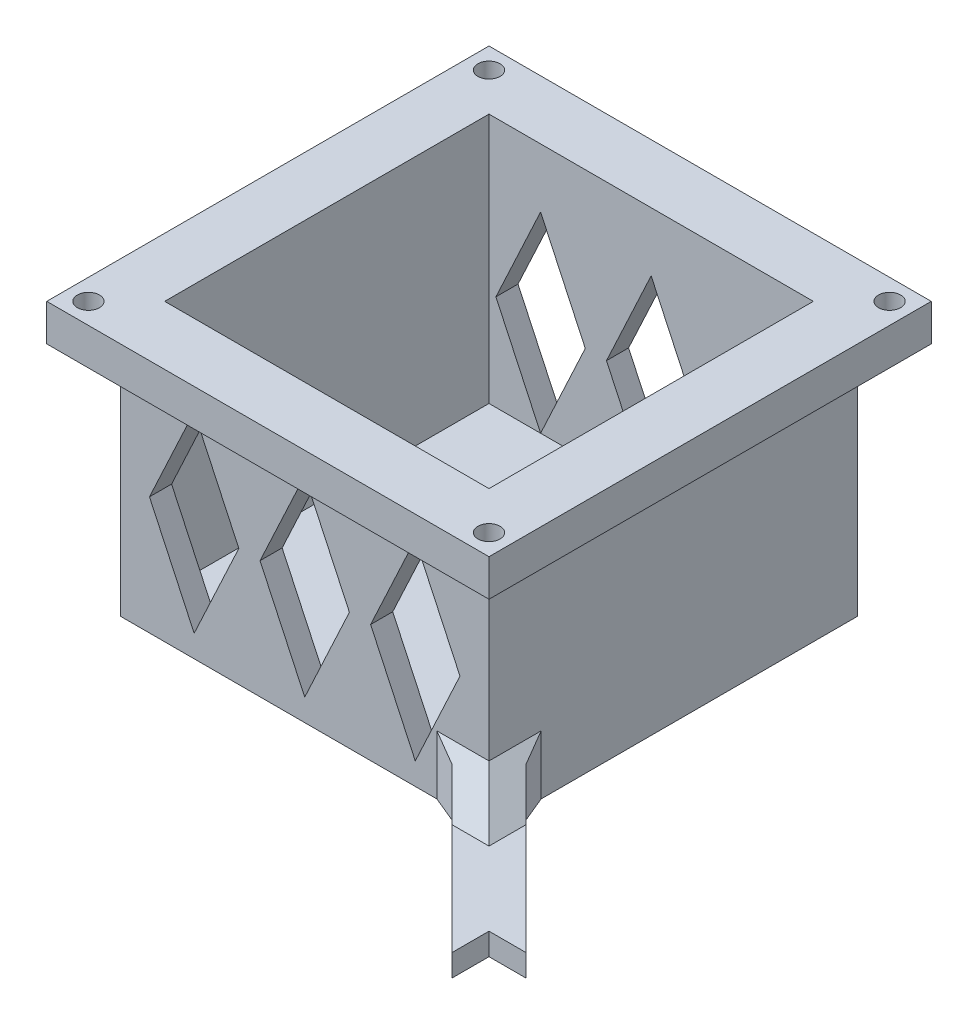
ISO-10303-21;
HEADER;
FILE_DESCRIPTION(('STEP AP214'),'2;1');
FILE_NAME('part.step','',(''),(''),'','','');
FILE_SCHEMA(('AUTOMOTIVE_DESIGN { 1 0 10303 214 1 1 1 1 }'));
ENDSEC;
DATA;
#1=APPLICATION_CONTEXT('core data for automotive mechanical design processes');
#2=APPLICATION_PROTOCOL_DEFINITION('international standard','automotive_design',2000,#1);
#3=PRODUCT_CONTEXT('',#1,'mechanical');
#4=PRODUCT('Part','Part','',(#3));
#5=PRODUCT_RELATED_PRODUCT_CATEGORY('part','',(#4));
#6=PRODUCT_DEFINITION_FORMATION('','',#4);
#7=PRODUCT_DEFINITION_CONTEXT('part definition',#1,'design');
#8=PRODUCT_DEFINITION('design','',#6,#7);
#9=PRODUCT_DEFINITION_SHAPE('','',#8);
#10=(LENGTH_UNIT() NAMED_UNIT(*) SI_UNIT(.MILLI.,.METRE.));
#11=(NAMED_UNIT(*) PLANE_ANGLE_UNIT() SI_UNIT($,.RADIAN.));
#12=(NAMED_UNIT(*) SI_UNIT($,.STERADIAN.) SOLID_ANGLE_UNIT());
#13=UNCERTAINTY_MEASURE_WITH_UNIT(LENGTH_MEASURE(1.E-05),#10,'distance_accuracy_value','');
#14=(GEOMETRIC_REPRESENTATION_CONTEXT(3) GLOBAL_UNCERTAINTY_ASSIGNED_CONTEXT((#13)) GLOBAL_UNIT_ASSIGNED_CONTEXT((#10,
#11,#12)) REPRESENTATION_CONTEXT('',''));
#15=CARTESIAN_POINT('',(0.,0.,0.));
#16=DIRECTION('',(0.,0.,1.));
#17=DIRECTION('',(1.,0.,0.));
#18=AXIS2_PLACEMENT_3D('',#15,#16,#17);
#19=CARTESIAN_POINT('',(0.,37.,0.));
#20=DIRECTION('',(0.,-1.,0.));
#21=DIRECTION('',(0.,0.,-1.));
#22=AXIS2_PLACEMENT_3D('',#19,#20,#21);
#23=PLANE('',#22);
#24=CARTESIAN_POINT('',(-2.17157287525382,37.,2.1715728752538));
#25=DIRECTION('',(0.,1.,0.));
#26=DIRECTION('',(0.,0.,1.));
#27=AXIS2_PLACEMENT_3D('',#24,#25,#26);
#28=CIRCLE('',#27,1.5);
#29=CARTESIAN_POINT('',(-2.17157287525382,37.,3.6715728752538));
#30=VERTEX_POINT('',#29);
#31=EDGE_CURVE('E552',#30,#30,#28,.T.);
#32=ORIENTED_EDGE('',*,*,#31,.F.);
#33=EDGE_LOOP('',(#32));
#34=FACE_BOUND('',#33,.T.);
#35=CARTESIAN_POINT('',(52.1715728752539,37.,2.17157287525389));
#36=DIRECTION('',(0.,1.,0.));
#37=DIRECTION('',(0.,0.,1.));
#38=AXIS2_PLACEMENT_3D('',#35,#36,#37);
#39=CIRCLE('',#38,1.5);
#40=CARTESIAN_POINT('',(52.1715728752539,37.,3.6715728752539));
#41=VERTEX_POINT('',#40);
#42=EDGE_CURVE('E566',#41,#41,#39,.T.);
#43=ORIENTED_EDGE('',*,*,#42,.F.);
#44=EDGE_LOOP('',(#43));
#45=FACE_BOUND('',#44,.T.);
#46=CARTESIAN_POINT('',(52.1715728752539,37.,-52.1715728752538));
#47=DIRECTION('',(0.,1.,0.));
#48=DIRECTION('',(0.,0.,1.));
#49=AXIS2_PLACEMENT_3D('',#46,#47,#48);
#50=CIRCLE('',#49,1.50000000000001);
#51=CARTESIAN_POINT('',(52.1715728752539,37.,-50.6715728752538));
#52=VERTEX_POINT('',#51);
#53=EDGE_CURVE('E553',#52,#52,#50,.T.);
#54=ORIENTED_EDGE('',*,*,#53,.F.);
#55=EDGE_LOOP('',(#54));
#56=FACE_BOUND('',#55,.T.);
#57=CARTESIAN_POINT('',(-2.17157287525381,37.,-52.1715728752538));
#58=DIRECTION('',(0.,1.,0.));
#59=DIRECTION('',(0.,0.,1.));
#60=AXIS2_PLACEMENT_3D('',#57,#58,#59);
#61=CIRCLE('',#60,1.5);
#62=CARTESIAN_POINT('',(-2.17157287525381,37.,-50.6715728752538));
#63=VERTEX_POINT('',#62);
#64=EDGE_CURVE('E562',#63,#63,#61,.T.);
#65=ORIENTED_EDGE('',*,*,#64,.F.);
#66=EDGE_LOOP('',(#65));
#67=FACE_BOUND('',#66,.T.);
#68=DIRECTION('',(1.,0.,0.));
#69=VECTOR('',#68,1.);
#70=CARTESIAN_POINT('',(3.,37.,-3.));
#71=LINE('',#70,#69);
#72=CARTESIAN_POINT('',(3.,37.,-3.));
#73=VERTEX_POINT('',#72);
#74=CARTESIAN_POINT('',(47.,37.,-3.));
#75=VERTEX_POINT('',#74);
#76=EDGE_CURVE('E676',#73,#75,#71,.T.);
#77=ORIENTED_EDGE('',*,*,#76,.F.);
#78=DIRECTION('',(0.,0.,1.));
#79=VECTOR('',#78,1.);
#80=CARTESIAN_POINT('',(3.,37.,-47.));
#81=LINE('',#80,#79);
#82=CARTESIAN_POINT('',(3.,37.,-47.));
#83=VERTEX_POINT('',#82);
#84=EDGE_CURVE('E680',#83,#73,#81,.T.);
#85=ORIENTED_EDGE('',*,*,#84,.F.);
#86=DIRECTION('',(-1.,0.,0.));
#87=VECTOR('',#86,1.);
#88=CARTESIAN_POINT('',(47.,37.,-47.));
#89=LINE('',#88,#87);
#90=CARTESIAN_POINT('',(47.,37.,-47.));
#91=VERTEX_POINT('',#90);
#92=EDGE_CURVE('E665',#91,#83,#89,.T.);
#93=ORIENTED_EDGE('',*,*,#92,.F.);
#94=DIRECTION('',(0.,0.,-1.));
#95=VECTOR('',#94,1.);
#96=CARTESIAN_POINT('',(47.,37.,-3.));
#97=LINE('',#96,#95);
#98=EDGE_CURVE('E671',#75,#91,#97,.T.);
#99=ORIENTED_EDGE('',*,*,#98,.F.);
#100=EDGE_LOOP('',(#77,#85,#93,#99));
#101=FACE_BOUND('',#100,.T.);
#102=DIRECTION('',(-1.,0.,0.));
#103=VECTOR('',#102,1.);
#104=CARTESIAN_POINT('',(55.,37.,-55.));
#105=LINE('',#104,#103);
#106=CARTESIAN_POINT('',(55.,37.,-55.));
#107=VERTEX_POINT('',#106);
#108=CARTESIAN_POINT('',(-5.,37.,-55.));
#109=VERTEX_POINT('',#108);
#110=EDGE_CURVE('E584',#107,#109,#105,.T.);
#111=ORIENTED_EDGE('',*,*,#110,.T.);
#112=DIRECTION('',(0.,0.,1.));
#113=VECTOR('',#112,1.);
#114=CARTESIAN_POINT('',(-5.,37.,-55.));
#115=LINE('',#114,#113);
#116=CARTESIAN_POINT('',(-5.,37.,5.));
#117=VERTEX_POINT('',#116);
#118=EDGE_CURVE('E606',#109,#117,#115,.T.);
#119=ORIENTED_EDGE('',*,*,#118,.T.);
#120=DIRECTION('',(1.,0.,0.));
#121=VECTOR('',#120,1.);
#122=CARTESIAN_POINT('',(-5.,37.,5.));
#123=LINE('',#122,#121);
#124=CARTESIAN_POINT('',(55.,37.,5.));
#125=VERTEX_POINT('',#124);
#126=EDGE_CURVE('E610',#117,#125,#123,.T.);
#127=ORIENTED_EDGE('',*,*,#126,.T.);
#128=DIRECTION('',(0.,0.,-1.));
#129=VECTOR('',#128,1.);
#130=CARTESIAN_POINT('',(55.,37.,5.));
#131=LINE('',#130,#129);
#132=EDGE_CURVE('E590',#125,#107,#131,.T.);
#133=ORIENTED_EDGE('',*,*,#132,.T.);
#134=EDGE_LOOP('',(#111,#119,#127,#133));
#135=FACE_BOUND('',#134,.T.);
#136=ADVANCED_FACE('F47',(#34,#45,#56,#67,#101,#135),#23,.F.);
#137=CARTESIAN_POINT('',(0.,3.,0.));
#138=DIRECTION('',(0.,-1.,0.));
#139=DIRECTION('',(0.,0.,-1.));
#140=AXIS2_PLACEMENT_3D('',#137,#138,#139);
#141=PLANE('',#140);
#142=DIRECTION('',(-1.,0.,0.));
#143=VECTOR('',#142,1.);
#144=CARTESIAN_POINT('',(47.,3.,-47.));
#145=LINE('',#144,#143);
#146=CARTESIAN_POINT('',(47.,3.,-47.));
#147=VERTEX_POINT('',#146);
#148=CARTESIAN_POINT('',(40.,2.9999999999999,-47.));
#149=VERTEX_POINT('',#148);
#150=EDGE_CURVE('E691',#147,#149,#145,.T.);
#151=ORIENTED_EDGE('',*,*,#150,.T.);
#152=CARTESIAN_POINT('',(25.,3.,-47.));
#153=VERTEX_POINT('',#152);
#154=EDGE_CURVE('E696',#149,#153,#145,.T.);
#155=ORIENTED_EDGE('',*,*,#154,.T.);
#156=CARTESIAN_POINT('',(10.,3.,-47.));
#157=VERTEX_POINT('',#156);
#158=EDGE_CURVE('E1049',#153,#157,#145,.T.);
#159=ORIENTED_EDGE('',*,*,#158,.T.);
#160=CARTESIAN_POINT('',(3.,3.,-47.));
#161=VERTEX_POINT('',#160);
#162=EDGE_CURVE('E697',#157,#161,#145,.T.);
#163=ORIENTED_EDGE('',*,*,#162,.T.);
#164=DIRECTION('',(0.,0.,1.));
#165=VECTOR('',#164,1.);
#166=CARTESIAN_POINT('',(3.,3.,-47.));
#167=LINE('',#166,#165);
#168=CARTESIAN_POINT('',(3.,3.,-3.));
#169=VERTEX_POINT('',#168);
#170=EDGE_CURVE('E675',#161,#169,#167,.T.);
#171=ORIENTED_EDGE('',*,*,#170,.T.);
#172=DIRECTION('',(1.,0.,0.));
#173=VECTOR('',#172,1.);
#174=CARTESIAN_POINT('',(3.,3.,-3.));
#175=LINE('',#174,#173);
#176=CARTESIAN_POINT('',(10.,3.,-3.));
#177=VERTEX_POINT('',#176);
#178=EDGE_CURVE('E704',#169,#177,#175,.T.);
#179=ORIENTED_EDGE('',*,*,#178,.T.);
#180=CARTESIAN_POINT('',(25.,3.,-3.));
#181=VERTEX_POINT('',#180);
#182=EDGE_CURVE('E708',#177,#181,#175,.T.);
#183=ORIENTED_EDGE('',*,*,#182,.T.);
#184=CARTESIAN_POINT('',(40.,2.9999999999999,-3.));
#185=VERTEX_POINT('',#184);
#186=EDGE_CURVE('E1043',#181,#185,#175,.T.);
#187=ORIENTED_EDGE('',*,*,#186,.T.);
#188=CARTESIAN_POINT('',(47.,3.,-3.));
#189=VERTEX_POINT('',#188);
#190=EDGE_CURVE('E709',#185,#189,#175,.T.);
#191=ORIENTED_EDGE('',*,*,#190,.T.);
#192=DIRECTION('',(0.,0.,-1.));
#193=VECTOR('',#192,1.);
#194=CARTESIAN_POINT('',(47.,3.,-3.));
#195=LINE('',#194,#193);
#196=EDGE_CURVE('E698',#189,#147,#195,.T.);
#197=ORIENTED_EDGE('',*,*,#196,.T.);
#198=EDGE_LOOP('',(#151,#155,#159,#163,#171,#179,#183,#187,#191,#197));
#199=FACE_BOUND('',#198,.T.);
#200=ADVANCED_FACE('F880',(#199),#141,.F.);
#201=CARTESIAN_POINT('',(3.,-62.2253967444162,-47.));
#202=DIRECTION('',(-1.,0.,0.));
#203=DIRECTION('',(0.,0.,1.));
#204=AXIS2_PLACEMENT_3D('',#201,#202,#203);
#205=PLANE('',#204);
#206=ORIENTED_EDGE('',*,*,#84,.T.);
#207=DIRECTION('',(0.,1.,0.));
#208=VECTOR('',#207,1.);
#209=CARTESIAN_POINT('',(3.,-62.2253967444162,-3.));
#210=LINE('',#209,#208);
#211=EDGE_CURVE('E690',#169,#73,#210,.T.);
#212=ORIENTED_EDGE('',*,*,#211,.F.);
#213=ORIENTED_EDGE('',*,*,#170,.F.);
#214=DIRECTION('',(0.,1.,0.));
#215=VECTOR('',#214,1.);
#216=CARTESIAN_POINT('',(3.,-62.2253967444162,-47.));
#217=LINE('',#216,#215);
#218=EDGE_CURVE('E695',#161,#83,#217,.T.);
#219=ORIENTED_EDGE('',*,*,#218,.T.);
#220=EDGE_LOOP('',(#206,#212,#213,#219));
#221=FACE_BOUND('',#220,.T.);
#222=ADVANCED_FACE('F886',(#221),#205,.F.);
#223=CARTESIAN_POINT('',(3.,-62.2253967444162,-3.));
#224=DIRECTION('',(0.,0.,1.));
#225=DIRECTION('',(1.,0.,0.));
#226=AXIS2_PLACEMENT_3D('',#223,#224,#225);
#227=PLANE('',#226);
#228=DIRECTION('',(-0.422618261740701,0.906307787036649,0.));
#229=VECTOR('',#228,1.);
#230=CARTESIAN_POINT('',(68.3329249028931,-31.7601535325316,-3.));
#231=LINE('',#230,#229);
#232=CARTESIAN_POINT('',(46.061999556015,15.9999999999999,-3.));
#233=VERTEX_POINT('',#232);
#234=CARTESIAN_POINT('',(40.,28.9999999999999,-3.));
#235=VERTEX_POINT('',#234);
#236=EDGE_CURVE('E511',#233,#235,#231,.T.);
#237=ORIENTED_EDGE('',*,*,#236,.T.);
#238=DIRECTION('',(-0.4226182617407,-0.90630778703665,0.));
#239=VECTOR('',#238,1.);
#240=CARTESIAN_POINT('',(-1.54978334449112,-60.1037979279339,-3.));
#241=LINE('',#240,#239);
#242=CARTESIAN_POINT('',(33.938000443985,15.9999999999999,-3.));
#243=VERTEX_POINT('',#242);
#244=EDGE_CURVE('E535',#235,#243,#241,.T.);
#245=ORIENTED_EDGE('',*,*,#244,.T.);
#246=DIRECTION('',(0.422618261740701,-0.906307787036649,0.));
#247=VECTOR('',#246,1.);
#248=CARTESIAN_POINT('',(58.3743471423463,-36.4039146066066,-3.));
#249=LINE('',#248,#247);
#250=EDGE_CURVE('E527',#243,#185,#249,.T.);
#251=ORIENTED_EDGE('',*,*,#250,.T.);
#252=ORIENTED_EDGE('',*,*,#186,.F.);
#253=DIRECTION('',(0.4226182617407,0.90630778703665,0.));
#254=VECTOR('',#253,1.);
#255=CARTESIAN_POINT('',(-3.91211265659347,-59.0022256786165,-3.));
#256=LINE('',#255,#254);
#257=CARTESIAN_POINT('',(31.061999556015,16.,-3.));
#258=VERTEX_POINT('',#257);
#259=EDGE_CURVE('E458',#181,#258,#256,.T.);
#260=ORIENTED_EDGE('',*,*,#259,.T.);
#261=DIRECTION('',(-0.422618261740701,0.906307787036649,0.));
#262=VECTOR('',#261,1.);
#263=CARTESIAN_POINT('',(56.012017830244,-37.505486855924,-3.));
#264=LINE('',#263,#262);
#265=CARTESIAN_POINT('',(25.,29.,-3.));
#266=VERTEX_POINT('',#265);
#267=EDGE_CURVE('E450',#258,#266,#264,.T.);
#268=ORIENTED_EDGE('',*,*,#267,.T.);
#269=DIRECTION('',(-0.4226182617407,-0.90630778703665,0.));
#270=VECTOR('',#269,1.);
#271=CARTESIAN_POINT('',(-13.8706904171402,-54.3584646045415,-3.));
#272=LINE('',#271,#270);
#273=CARTESIAN_POINT('',(18.938000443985,16.,-3.));
#274=VERTEX_POINT('',#273);
#275=EDGE_CURVE('E474',#266,#274,#272,.T.);
#276=ORIENTED_EDGE('',*,*,#275,.T.);
#277=DIRECTION('',(0.422618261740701,-0.906307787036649,0.));
#278=VECTOR('',#277,1.);
#279=CARTESIAN_POINT('',(46.0534400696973,-42.149247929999,-3.));
#280=LINE('',#279,#278);
#281=EDGE_CURVE('E466',#274,#181,#280,.T.);
#282=ORIENTED_EDGE('',*,*,#281,.T.);
#283=ORIENTED_EDGE('',*,*,#182,.F.);
#284=DIRECTION('',(0.4226182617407,0.90630778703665,0.));
#285=VECTOR('',#284,1.);
#286=CARTESIAN_POINT('',(-16.2330197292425,-53.2568923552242,-3.));
#287=LINE('',#286,#285);
#288=CARTESIAN_POINT('',(16.061999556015,16.,-3.));
#289=VERTEX_POINT('',#288);
#290=EDGE_CURVE('E487',#177,#289,#287,.T.);
#291=ORIENTED_EDGE('',*,*,#290,.T.);
#292=DIRECTION('',(-0.422618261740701,0.906307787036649,0.));
#293=VECTOR('',#292,1.);
#294=CARTESIAN_POINT('',(43.691110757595,-43.2508201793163,-3.));
#295=LINE('',#294,#293);
#296=CARTESIAN_POINT('',(10.,29.,-3.));
#297=VERTEX_POINT('',#296);
#298=EDGE_CURVE('E481',#289,#297,#295,.T.);
#299=ORIENTED_EDGE('',*,*,#298,.T.);
#300=DIRECTION('',(-0.4226182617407,-0.90630778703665,0.));
#301=VECTOR('',#300,1.);
#302=CARTESIAN_POINT('',(-26.1915974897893,-48.6131312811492,-3.));
#303=LINE('',#302,#301);
#304=CARTESIAN_POINT('',(3.938000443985,16.,-3.));
#305=VERTEX_POINT('',#304);
#306=EDGE_CURVE('E503',#297,#305,#303,.T.);
#307=ORIENTED_EDGE('',*,*,#306,.T.);
#308=DIRECTION('',(0.422618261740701,-0.906307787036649,0.));
#309=VECTOR('',#308,1.);
#310=CARTESIAN_POINT('',(33.7325329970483,-47.8945812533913,-3.));
#311=LINE('',#310,#309);
#312=EDGE_CURVE('E495',#305,#177,#311,.T.);
#313=ORIENTED_EDGE('',*,*,#312,.T.);
#314=ORIENTED_EDGE('',*,*,#178,.F.);
#315=ORIENTED_EDGE('',*,*,#211,.T.);
#316=ORIENTED_EDGE('',*,*,#76,.T.);
#317=DIRECTION('',(0.,1.,0.));
#318=VECTOR('',#317,1.);
#319=CARTESIAN_POINT('',(47.,-62.2253967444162,-3.));
#320=LINE('',#319,#318);
#321=EDGE_CURVE('E703',#189,#75,#320,.T.);
#322=ORIENTED_EDGE('',*,*,#321,.F.);
#323=ORIENTED_EDGE('',*,*,#190,.F.);
#324=DIRECTION('',(0.422618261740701,0.906307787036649,0.));
#325=VECTOR('',#324,1.);
#326=CARTESIAN_POINT('',(8.40879441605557,-64.7475590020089,-3.));
#327=LINE('',#326,#325);
#328=EDGE_CURVE('E519',#185,#233,#327,.T.);
#329=ORIENTED_EDGE('',*,*,#328,.T.);
#330=EDGE_LOOP('',(#237,#245,#251,#252,#260,#268,#276,#282,#283,#291,#299,#307,#313,#314,#315,
#316,#322,#323,#329));
#331=FACE_BOUND('',#330,.T.);
#332=ADVANCED_FACE('F1015',(#331),#227,.F.);
#333=CARTESIAN_POINT('',(47.,-62.2253967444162,-3.));
#334=DIRECTION('',(1.,0.,0.));
#335=DIRECTION('',(0.,0.,-1.));
#336=AXIS2_PLACEMENT_3D('',#333,#334,#335);
#337=PLANE('',#336);
#338=ORIENTED_EDGE('',*,*,#98,.T.);
#339=DIRECTION('',(0.,1.,0.));
#340=VECTOR('',#339,1.);
#341=CARTESIAN_POINT('',(47.,-62.2253967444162,-47.));
#342=LINE('',#341,#340);
#343=EDGE_CURVE('E702',#147,#91,#342,.T.);
#344=ORIENTED_EDGE('',*,*,#343,.F.);
#345=ORIENTED_EDGE('',*,*,#196,.F.);
#346=ORIENTED_EDGE('',*,*,#321,.T.);
#347=EDGE_LOOP('',(#338,#344,#345,#346));
#348=FACE_BOUND('',#347,.T.);
#349=ADVANCED_FACE('F1011',(#348),#337,.F.);
#350=CARTESIAN_POINT('',(47.,-62.2253967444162,-47.));
#351=DIRECTION('',(0.,0.,-1.));
#352=DIRECTION('',(-1.,0.,0.));
#353=AXIS2_PLACEMENT_3D('',#350,#351,#352);
#354=PLANE('',#353);
#355=DIRECTION('',(-0.422618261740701,0.906307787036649,0.));
#356=VECTOR('',#355,1.);
#357=CARTESIAN_POINT('',(66.2330197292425,-53.2568923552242,-47.));
#358=LINE('',#357,#356);
#359=CARTESIAN_POINT('',(33.938000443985,15.9999999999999,-47.));
#360=VERTEX_POINT('',#359);
#361=EDGE_CURVE('E523',#149,#360,#358,.T.);
#362=ORIENTED_EDGE('',*,*,#361,.T.);
#363=DIRECTION('',(0.4226182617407,0.90630778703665,0.));
#364=VECTOR('',#363,1.);
#365=CARTESIAN_POINT('',(6.30888924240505,-43.2508201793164,-47.));
#366=LINE('',#365,#364);
#367=CARTESIAN_POINT('',(40.,28.9999999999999,-47.));
#368=VERTEX_POINT('',#367);
#369=EDGE_CURVE('E531',#360,#368,#366,.T.);
#370=ORIENTED_EDGE('',*,*,#369,.T.);
#371=DIRECTION('',(0.422618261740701,-0.906307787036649,0.));
#372=VECTOR('',#371,1.);
#373=CARTESIAN_POINT('',(76.1915974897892,-48.6131312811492,-47.));
#374=LINE('',#373,#372);
#375=CARTESIAN_POINT('',(46.061999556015,15.9999999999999,-47.));
#376=VERTEX_POINT('',#375);
#377=EDGE_CURVE('E507',#368,#376,#374,.T.);
#378=ORIENTED_EDGE('',*,*,#377,.T.);
#379=DIRECTION('',(-0.422618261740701,-0.906307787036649,0.));
#380=VECTOR('',#379,1.);
#381=CARTESIAN_POINT('',(16.2674670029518,-47.8945812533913,-47.));
#382=LINE('',#381,#380);
#383=EDGE_CURVE('E515',#376,#149,#382,.T.);
#384=ORIENTED_EDGE('',*,*,#383,.T.);
#385=ORIENTED_EDGE('',*,*,#150,.F.);
#386=ORIENTED_EDGE('',*,*,#343,.T.);
#387=ORIENTED_EDGE('',*,*,#92,.T.);
#388=ORIENTED_EDGE('',*,*,#218,.F.);
#389=ORIENTED_EDGE('',*,*,#162,.F.);
#390=DIRECTION('',(-0.422618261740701,0.906307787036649,0.));
#391=VECTOR('',#390,1.);
#392=CARTESIAN_POINT('',(41.5912055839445,-64.7475590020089,-47.));
#393=LINE('',#392,#391);
#394=CARTESIAN_POINT('',(3.938000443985,16.,-47.));
#395=VERTEX_POINT('',#394);
#396=EDGE_CURVE('E491',#157,#395,#393,.T.);
#397=ORIENTED_EDGE('',*,*,#396,.T.);
#398=DIRECTION('',(0.4226182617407,0.90630778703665,0.));
#399=VECTOR('',#398,1.);
#400=CARTESIAN_POINT('',(-18.3329249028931,-31.7601535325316,-47.));
#401=LINE('',#400,#399);
#402=CARTESIAN_POINT('',(10.,29.,-47.));
#403=VERTEX_POINT('',#402);
#404=EDGE_CURVE('E499',#395,#403,#401,.T.);
#405=ORIENTED_EDGE('',*,*,#404,.T.);
#406=DIRECTION('',(0.422618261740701,-0.906307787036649,0.));
#407=VECTOR('',#406,1.);
#408=CARTESIAN_POINT('',(51.5497833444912,-60.1037979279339,-47.));
#409=LINE('',#408,#407);
#410=CARTESIAN_POINT('',(16.061999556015,16.,-47.));
#411=VERTEX_POINT('',#410);
#412=EDGE_CURVE('E478',#403,#411,#409,.T.);
#413=ORIENTED_EDGE('',*,*,#412,.T.);
#414=DIRECTION('',(-0.4226182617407,-0.90630778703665,0.));
#415=VECTOR('',#414,1.);
#416=CARTESIAN_POINT('',(-8.37434714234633,-36.4039146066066,-47.));
#417=LINE('',#416,#415);
#418=EDGE_CURVE('E344',#411,#157,#417,.T.);
#419=ORIENTED_EDGE('',*,*,#418,.T.);
#420=ORIENTED_EDGE('',*,*,#158,.F.);
#421=DIRECTION('',(-0.422618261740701,0.906307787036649,0.));
#422=VECTOR('',#421,1.);
#423=CARTESIAN_POINT('',(53.9121126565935,-59.0022256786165,-47.));
#424=LINE('',#423,#422);
#425=CARTESIAN_POINT('',(18.938000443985,16.,-47.));
#426=VERTEX_POINT('',#425);
#427=EDGE_CURVE('E462',#153,#426,#424,.T.);
#428=ORIENTED_EDGE('',*,*,#427,.T.);
#429=DIRECTION('',(0.4226182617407,0.90630778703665,0.));
#430=VECTOR('',#429,1.);
#431=CARTESIAN_POINT('',(-6.01201783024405,-37.505486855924,-47.));
#432=LINE('',#431,#430);
#433=CARTESIAN_POINT('',(25.,29.,-47.));
#434=VERTEX_POINT('',#433);
#435=EDGE_CURVE('E470',#426,#434,#432,.T.);
#436=ORIENTED_EDGE('',*,*,#435,.T.);
#437=DIRECTION('',(0.422618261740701,-0.906307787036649,0.));
#438=VECTOR('',#437,1.);
#439=CARTESIAN_POINT('',(63.8706904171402,-54.3584646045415,-47.));
#440=LINE('',#439,#438);
#441=CARTESIAN_POINT('',(31.061999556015,16.,-47.));
#442=VERTEX_POINT('',#441);
#443=EDGE_CURVE('E446',#434,#442,#440,.T.);
#444=ORIENTED_EDGE('',*,*,#443,.T.);
#445=DIRECTION('',(-0.4226182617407,-0.90630778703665,0.));
#446=VECTOR('',#445,1.);
#447=CARTESIAN_POINT('',(3.94655993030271,-42.149247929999,-47.));
#448=LINE('',#447,#446);
#449=EDGE_CURVE('E454',#442,#153,#448,.T.);
#450=ORIENTED_EDGE('',*,*,#449,.T.);
#451=ORIENTED_EDGE('',*,*,#154,.F.);
#452=EDGE_LOOP('',(#362,#370,#378,#384,#385,#386,#387,#388,#389,#397,#405,#413,#419,#420,#428,
#436,#444,#450,#451));
#453=FACE_BOUND('',#452,.T.);
#454=ADVANCED_FACE('F1008',(#453),#354,.F.);
#455=CARTESIAN_POINT('',(0.,32.,0.));
#456=DIRECTION('',(0.,1.,0.));
#457=DIRECTION('',(0.,0.,1.));
#458=AXIS2_PLACEMENT_3D('',#455,#456,#457);
#459=PLANE('',#458);
#460=CARTESIAN_POINT('',(-2.17157287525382,32.,2.1715728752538));
#461=DIRECTION('',(0.,1.,0.));
#462=DIRECTION('',(0.,0.,1.));
#463=AXIS2_PLACEMENT_3D('',#460,#461,#462);
#464=CIRCLE('',#463,1.5);
#465=CARTESIAN_POINT('',(-2.17157287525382,32.,3.6715728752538));
#466=VERTEX_POINT('',#465);
#467=EDGE_CURVE('E570',#466,#466,#464,.F.);
#468=ORIENTED_EDGE('',*,*,#467,.F.);
#469=EDGE_LOOP('',(#468));
#470=FACE_BOUND('',#469,.T.);
#471=CARTESIAN_POINT('',(52.1715728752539,32.,2.17157287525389));
#472=DIRECTION('',(0.,1.,0.));
#473=DIRECTION('',(0.,0.,1.));
#474=AXIS2_PLACEMENT_3D('',#471,#472,#473);
#475=CIRCLE('',#474,1.5);
#476=CARTESIAN_POINT('',(52.1715728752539,32.,3.6715728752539));
#477=VERTEX_POINT('',#476);
#478=EDGE_CURVE('E558',#477,#477,#475,.F.);
#479=ORIENTED_EDGE('',*,*,#478,.F.);
#480=EDGE_LOOP('',(#479));
#481=FACE_BOUND('',#480,.T.);
#482=CARTESIAN_POINT('',(52.1715728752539,32.,-52.1715728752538));
#483=DIRECTION('',(0.,1.,0.));
#484=DIRECTION('',(0.,0.,1.));
#485=AXIS2_PLACEMENT_3D('',#482,#483,#484);
#486=CIRCLE('',#485,1.50000000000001);
#487=CARTESIAN_POINT('',(52.1715728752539,32.,-50.6715728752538));
#488=VERTEX_POINT('',#487);
#489=EDGE_CURVE('E557',#488,#488,#486,.F.);
#490=ORIENTED_EDGE('',*,*,#489,.F.);
#491=EDGE_LOOP('',(#490));
#492=FACE_BOUND('',#491,.T.);
#493=CARTESIAN_POINT('',(-2.17157287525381,32.,-52.1715728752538));
#494=DIRECTION('',(0.,1.,0.));
#495=DIRECTION('',(0.,0.,1.));
#496=AXIS2_PLACEMENT_3D('',#493,#494,#495);
#497=CIRCLE('',#496,1.5);
#498=CARTESIAN_POINT('',(-2.17157287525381,32.,-50.6715728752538));
#499=VERTEX_POINT('',#498);
#500=EDGE_CURVE('E580',#499,#499,#497,.F.);
#501=ORIENTED_EDGE('',*,*,#500,.F.);
#502=EDGE_LOOP('',(#501));
#503=FACE_BOUND('',#502,.T.);
#504=DIRECTION('',(-1.,0.,0.));
#505=VECTOR('',#504,1.);
#506=CARTESIAN_POINT('',(55.,32.,-55.));
#507=LINE('',#506,#505);
#508=CARTESIAN_POINT('',(55.,32.,-55.));
#509=VERTEX_POINT('',#508);
#510=CARTESIAN_POINT('',(-5.,32.,-55.));
#511=VERTEX_POINT('',#510);
#512=EDGE_CURVE('E585',#509,#511,#507,.T.);
#513=ORIENTED_EDGE('',*,*,#512,.F.);
#514=DIRECTION('',(0.,0.,-1.));
#515=VECTOR('',#514,1.);
#516=CARTESIAN_POINT('',(55.,32.,5.));
#517=LINE('',#516,#515);
#518=CARTESIAN_POINT('',(55.,32.,5.));
#519=VERTEX_POINT('',#518);
#520=EDGE_CURVE('E598',#519,#509,#517,.T.);
#521=ORIENTED_EDGE('',*,*,#520,.F.);
#522=DIRECTION('',(1.,0.,0.));
#523=VECTOR('',#522,1.);
#524=CARTESIAN_POINT('',(-5.,32.,5.));
#525=LINE('',#524,#523);
#526=CARTESIAN_POINT('',(-5.,32.,5.));
#527=VERTEX_POINT('',#526);
#528=EDGE_CURVE('E594',#527,#519,#525,.T.);
#529=ORIENTED_EDGE('',*,*,#528,.F.);
#530=DIRECTION('',(0.,0.,1.));
#531=VECTOR('',#530,1.);
#532=CARTESIAN_POINT('',(-5.,32.,-55.));
#533=LINE('',#532,#531);
#534=EDGE_CURVE('E589',#511,#527,#533,.T.);
#535=ORIENTED_EDGE('',*,*,#534,.F.);
#536=EDGE_LOOP('',(#513,#521,#529,#535));
#537=FACE_BOUND('',#536,.T.);
#538=DIRECTION('',(-1.,0.,0.));
#539=VECTOR('',#538,1.);
#540=CARTESIAN_POINT('',(0.,32.,-50.));
#541=LINE('',#540,#539);
#542=CARTESIAN_POINT('',(50.,32.,-50.));
#543=VERTEX_POINT('',#542);
#544=CARTESIAN_POINT('',(0.,32.,-50.));
#545=VERTEX_POINT('',#544);
#546=EDGE_CURVE('E620',#543,#545,#541,.T.);
#547=ORIENTED_EDGE('',*,*,#546,.T.);
#548=DIRECTION('',(0.,0.,1.));
#549=VECTOR('',#548,1.);
#550=CARTESIAN_POINT('',(0.,32.,0.));
#551=LINE('',#550,#549);
#552=CARTESIAN_POINT('',(0.,32.,0.));
#553=VERTEX_POINT('',#552);
#554=EDGE_CURVE('E640',#545,#553,#551,.T.);
#555=ORIENTED_EDGE('',*,*,#554,.T.);
#556=DIRECTION('',(1.,0.,0.));
#557=VECTOR('',#556,1.);
#558=CARTESIAN_POINT('',(0.,32.,0.));
#559=LINE('',#558,#557);
#560=CARTESIAN_POINT('',(50.,32.,0.));
#561=VERTEX_POINT('',#560);
#562=EDGE_CURVE('E636',#553,#561,#559,.T.);
#563=ORIENTED_EDGE('',*,*,#562,.T.);
#564=DIRECTION('',(0.,0.,-1.));
#565=VECTOR('',#564,1.);
#566=CARTESIAN_POINT('',(50.,32.,0.));
#567=LINE('',#566,#565);
#568=EDGE_CURVE('E632',#561,#543,#567,.T.);
#569=ORIENTED_EDGE('',*,*,#568,.T.);
#570=EDGE_LOOP('',(#547,#555,#563,#569));
#571=FACE_BOUND('',#570,.T.);
#572=ADVANCED_FACE('F860',(#470,#481,#492,#503,#537,#571),#459,.F.);
#573=CARTESIAN_POINT('',(55.,32.,-55.));
#574=DIRECTION('',(0.,0.,-1.));
#575=DIRECTION('',(-1.,0.,0.));
#576=AXIS2_PLACEMENT_3D('',#573,#574,#575);
#577=PLANE('',#576);
#578=ORIENTED_EDGE('',*,*,#110,.F.);
#579=DIRECTION('',(0.,1.,0.));
#580=VECTOR('',#579,1.);
#581=CARTESIAN_POINT('',(55.,32.,-55.));
#582=LINE('',#581,#580);
#583=EDGE_CURVE('E617',#509,#107,#582,.T.);
#584=ORIENTED_EDGE('',*,*,#583,.F.);
#585=ORIENTED_EDGE('',*,*,#512,.T.);
#586=DIRECTION('',(0.,1.,0.));
#587=VECTOR('',#586,1.);
#588=CARTESIAN_POINT('',(-5.,32.,-55.));
#589=LINE('',#588,#587);
#590=EDGE_CURVE('E602',#511,#109,#589,.T.);
#591=ORIENTED_EDGE('',*,*,#590,.T.);
#592=EDGE_LOOP('',(#578,#584,#585,#591));
#593=FACE_BOUND('',#592,.T.);
#594=ADVANCED_FACE('F1173',(#593),#577,.T.);
#595=CARTESIAN_POINT('',(55.,32.,5.));
#596=DIRECTION('',(1.,0.,0.));
#597=DIRECTION('',(0.,0.,-1.));
#598=AXIS2_PLACEMENT_3D('',#595,#596,#597);
#599=PLANE('',#598);
#600=ORIENTED_EDGE('',*,*,#132,.F.);
#601=DIRECTION('',(0.,1.,0.));
#602=VECTOR('',#601,1.);
#603=CARTESIAN_POINT('',(55.,32.,5.));
#604=LINE('',#603,#602);
#605=EDGE_CURVE('E621',#519,#125,#604,.T.);
#606=ORIENTED_EDGE('',*,*,#605,.F.);
#607=ORIENTED_EDGE('',*,*,#520,.T.);
#608=ORIENTED_EDGE('',*,*,#583,.T.);
#609=EDGE_LOOP('',(#600,#606,#607,#608));
#610=FACE_BOUND('',#609,.T.);
#611=ADVANCED_FACE('F1175',(#610),#599,.T.);
#612=CARTESIAN_POINT('',(-5.,32.,5.));
#613=DIRECTION('',(0.,0.,1.));
#614=DIRECTION('',(1.,0.,0.));
#615=AXIS2_PLACEMENT_3D('',#612,#613,#614);
#616=PLANE('',#615);
#617=ORIENTED_EDGE('',*,*,#126,.F.);
#618=DIRECTION('',(0.,1.,0.));
#619=VECTOR('',#618,1.);
#620=CARTESIAN_POINT('',(-5.,32.,5.));
#621=LINE('',#620,#619);
#622=EDGE_CURVE('E624',#527,#117,#621,.T.);
#623=ORIENTED_EDGE('',*,*,#622,.F.);
#624=ORIENTED_EDGE('',*,*,#528,.T.);
#625=ORIENTED_EDGE('',*,*,#605,.T.);
#626=EDGE_LOOP('',(#617,#623,#624,#625));
#627=FACE_BOUND('',#626,.T.);
#628=ADVANCED_FACE('F1178',(#627),#616,.T.);
#629=CARTESIAN_POINT('',(-5.,32.,-55.));
#630=DIRECTION('',(-1.,0.,0.));
#631=DIRECTION('',(0.,0.,1.));
#632=AXIS2_PLACEMENT_3D('',#629,#630,#631);
#633=PLANE('',#632);
#634=ORIENTED_EDGE('',*,*,#118,.F.);
#635=ORIENTED_EDGE('',*,*,#590,.F.);
#636=ORIENTED_EDGE('',*,*,#534,.T.);
#637=ORIENTED_EDGE('',*,*,#622,.T.);
#638=EDGE_LOOP('',(#634,#635,#636,#637));
#639=FACE_BOUND('',#638,.T.);
#640=ADVANCED_FACE('F1005',(#639),#633,.T.);
#641=CARTESIAN_POINT('',(65.,3.,20.));
#642=DIRECTION('',(1.,0.,0.));
#643=DIRECTION('',(0.,0.,-1.));
#644=AXIS2_PLACEMENT_3D('',#641,#642,#643);
#645=PLANE('',#644);
#646=DIRECTION('',(0.,0.,1.));
#647=VECTOR('',#646,1.);
#648=CARTESIAN_POINT('',(65.,0.,20.));
#649=LINE('',#648,#647);
#650=CARTESIAN_POINT('',(65.,0.,15.));
#651=VERTEX_POINT('',#650);
#652=CARTESIAN_POINT('',(65.,0.,20.));
#653=VERTEX_POINT('',#652);
#654=EDGE_CURVE('E650',#651,#653,#649,.T.);
#655=ORIENTED_EDGE('',*,*,#654,.F.);
#656=DIRECTION('',(0.,-1.,0.));
#657=VECTOR('',#656,1.);
#658=CARTESIAN_POINT('',(65.,3.,15.));
#659=LINE('',#658,#657);
#660=CARTESIAN_POINT('',(65.,3.,15.));
#661=VERTEX_POINT('',#660);
#662=EDGE_CURVE('E666',#661,#651,#659,.T.);
#663=ORIENTED_EDGE('',*,*,#662,.F.);
#664=DIRECTION('',(0.,0.,1.));
#665=VECTOR('',#664,1.);
#666=CARTESIAN_POINT('',(65.,3.,20.));
#667=LINE('',#666,#665);
#668=CARTESIAN_POINT('',(65.,3.,20.));
#669=VERTEX_POINT('',#668);
#670=EDGE_CURVE('E649',#661,#669,#667,.T.);
#671=ORIENTED_EDGE('',*,*,#670,.T.);
#672=DIRECTION('',(0.,-1.,0.));
#673=VECTOR('',#672,1.);
#674=CARTESIAN_POINT('',(65.,3.,20.));
#675=LINE('',#674,#673);
#676=EDGE_CURVE('E661',#669,#653,#675,.T.);
#677=ORIENTED_EDGE('',*,*,#676,.T.);
#678=EDGE_LOOP('',(#655,#663,#671,#677));
#679=FACE_BOUND('',#678,.T.);
#680=ADVANCED_FACE('F991',(#679),#645,.T.);
#681=CARTESIAN_POINT('',(65.,3.,15.));
#682=DIRECTION('',(0.,0.,1.));
#683=DIRECTION('',(1.,0.,0.));
#684=AXIS2_PLACEMENT_3D('',#681,#682,#683);
#685=PLANE('',#684);
#686=DIRECTION('',(-1.,0.,0.));
#687=VECTOR('',#686,1.);
#688=CARTESIAN_POINT('',(65.,0.,15.));
#689=LINE('',#688,#687);
#690=CARTESIAN_POINT('',(70.,0.,15.));
#691=VERTEX_POINT('',#690);
#692=EDGE_CURVE('E644',#691,#651,#689,.T.);
#693=ORIENTED_EDGE('',*,*,#692,.F.);
#694=DIRECTION('',(0.,-1.,0.));
#695=VECTOR('',#694,1.);
#696=CARTESIAN_POINT('',(70.,3.,15.));
#697=LINE('',#696,#695);
#698=CARTESIAN_POINT('',(70.,3.,15.));
#699=VERTEX_POINT('',#698);
#700=EDGE_CURVE('E654',#699,#691,#697,.T.);
#701=ORIENTED_EDGE('',*,*,#700,.F.);
#702=DIRECTION('',(-1.,0.,0.));
#703=VECTOR('',#702,1.);
#704=CARTESIAN_POINT('',(65.,3.,15.));
#705=LINE('',#704,#703);
#706=EDGE_CURVE('E645',#699,#661,#705,.T.);
#707=ORIENTED_EDGE('',*,*,#706,.T.);
#708=ORIENTED_EDGE('',*,*,#662,.T.);
#709=EDGE_LOOP('',(#693,#701,#707,#708));
#710=FACE_BOUND('',#709,.T.);
#711=ADVANCED_FACE('F994',(#710),#685,.T.);
#712=CARTESIAN_POINT('',(0.,3.,0.));
#713=DIRECTION('',(0.,-1.,0.));
#714=DIRECTION('',(0.,0.,-1.));
#715=AXIS2_PLACEMENT_3D('',#712,#713,#714);
#716=PLANE('',#715);
#717=DIRECTION('',(0.,0.,1.));
#718=VECTOR('',#717,1.);
#719=CARTESIAN_POINT('',(55.,3.,0.));
#720=LINE('',#719,#718);
#721=CARTESIAN_POINT('',(55.,3.,0.));
#722=VERTEX_POINT('',#721);
#723=CARTESIAN_POINT('',(55.,3.,5.));
#724=VERTEX_POINT('',#723);
#725=EDGE_CURVE('E802',#722,#724,#720,.T.);
#726=ORIENTED_EDGE('',*,*,#725,.T.);
#727=DIRECTION('',(-1.,0.,0.));
#728=VECTOR('',#727,1.);
#729=CARTESIAN_POINT('',(45.,3.,5.));
#730=LINE('',#729,#728);
#731=CARTESIAN_POINT('',(50.,3.,5.));
#732=VERTEX_POINT('',#731);
#733=EDGE_CURVE('E805',#724,#732,#730,.T.);
#734=ORIENTED_EDGE('',*,*,#733,.T.);
#735=DIRECTION('',(-0.707106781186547,0.,-0.707106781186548));
#736=VECTOR('',#735,1.);
#737=CARTESIAN_POINT('',(65.,3.,20.));
#738=LINE('',#737,#736);
#739=EDGE_CURVE('E539',#669,#732,#738,.T.);
#740=ORIENTED_EDGE('',*,*,#739,.F.);
#741=ORIENTED_EDGE('',*,*,#670,.F.);
#742=ORIENTED_EDGE('',*,*,#706,.F.);
#743=DIRECTION('',(0.707106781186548,0.,0.707106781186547));
#744=VECTOR('',#743,1.);
#745=CARTESIAN_POINT('',(50.,3.,-5.));
#746=LINE('',#745,#744);
#747=EDGE_CURVE('E543',#722,#699,#746,.T.);
#748=ORIENTED_EDGE('',*,*,#747,.F.);
#749=EDGE_LOOP('',(#726,#734,#740,#741,#742,#748));
#750=FACE_BOUND('',#749,.T.);
#751=ADVANCED_FACE('F895',(#750),#716,.F.);
#752=CARTESIAN_POINT('',(0.,0.,0.));
#753=DIRECTION('',(0.,-1.,0.));
#754=DIRECTION('',(0.,0.,-1.));
#755=AXIS2_PLACEMENT_3D('',#752,#753,#754);
#756=PLANE('',#755);
#757=DIRECTION('',(0.707106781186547,0.,0.707106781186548));
#758=VECTOR('',#757,1.);
#759=CARTESIAN_POINT('',(22.5,0.,-22.5));
#760=LINE('',#759,#758);
#761=CARTESIAN_POINT('',(46.4644660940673,0.,1.46446609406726));
#762=VERTEX_POINT('',#761);
#763=EDGE_CURVE('E546',#762,#653,#760,.T.);
#764=ORIENTED_EDGE('',*,*,#763,.F.);
#765=DIRECTION('',(0.923879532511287,0.,0.38268343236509));
#766=VECTOR('',#765,1.);
#767=CARTESIAN_POINT('',(46.4644660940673,0.,1.46446609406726));
#768=LINE('',#767,#766);
#769=CARTESIAN_POINT('',(42.9289321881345,0.,0.));
#770=VERTEX_POINT('',#769);
#771=EDGE_CURVE('E58',#762,#770,#768,.F.);
#772=ORIENTED_EDGE('',*,*,#771,.T.);
#773=DIRECTION('',(1.,0.,0.));
#774=VECTOR('',#773,1.);
#775=CARTESIAN_POINT('',(0.,0.,0.));
#776=LINE('',#775,#774);
#777=CARTESIAN_POINT('',(0.,0.,0.));
#778=VERTEX_POINT('',#777);
#779=EDGE_CURVE('E722',#778,#770,#776,.T.);
#780=ORIENTED_EDGE('',*,*,#779,.F.);
#781=DIRECTION('',(0.,0.,1.));
#782=VECTOR('',#781,1.);
#783=CARTESIAN_POINT('',(0.,0.,0.));
#784=LINE('',#783,#782);
#785=CARTESIAN_POINT('',(0.,0.,-50.));
#786=VERTEX_POINT('',#785);
#787=EDGE_CURVE('E718',#786,#778,#784,.T.);
#788=ORIENTED_EDGE('',*,*,#787,.F.);
#789=DIRECTION('',(-1.,0.,0.));
#790=VECTOR('',#789,1.);
#791=CARTESIAN_POINT('',(0.,0.,-50.));
#792=LINE('',#791,#790);
#793=CARTESIAN_POINT('',(50.,0.,-50.));
#794=VERTEX_POINT('',#793);
#795=EDGE_CURVE('E729',#794,#786,#792,.T.);
#796=ORIENTED_EDGE('',*,*,#795,.F.);
#797=DIRECTION('',(0.,0.,-1.));
#798=VECTOR('',#797,1.);
#799=CARTESIAN_POINT('',(50.,0.,0.));
#800=LINE('',#799,#798);
#801=CARTESIAN_POINT('',(50.,0.,-7.07106781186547));
#802=VERTEX_POINT('',#801);
#803=EDGE_CURVE('E726',#802,#794,#800,.T.);
#804=ORIENTED_EDGE('',*,*,#803,.F.);
#805=DIRECTION('',(-0.382683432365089,0.,-0.923879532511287));
#806=VECTOR('',#805,1.);
#807=CARTESIAN_POINT('',(50.,0.,-7.07106781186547));
#808=LINE('',#807,#806);
#809=CARTESIAN_POINT('',(51.4644660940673,0.,-3.53553390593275));
#810=VERTEX_POINT('',#809);
#811=EDGE_CURVE('E14',#802,#810,#808,.F.);
#812=ORIENTED_EDGE('',*,*,#811,.T.);
#813=DIRECTION('',(-0.707106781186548,0.,-0.707106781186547));
#814=VECTOR('',#813,1.);
#815=CARTESIAN_POINT('',(27.5,0.,-27.5));
#816=LINE('',#815,#814);
#817=EDGE_CURVE('E549',#691,#810,#816,.T.);
#818=ORIENTED_EDGE('',*,*,#817,.F.);
#819=ORIENTED_EDGE('',*,*,#692,.T.);
#820=ORIENTED_EDGE('',*,*,#654,.T.);
#821=EDGE_LOOP('',(#764,#772,#780,#788,#796,#804,#812,#818,#819,#820));
#822=FACE_BOUND('',#821,.T.);
#823=ADVANCED_FACE('F852',(#822),#756,.T.);
#824=CARTESIAN_POINT('',(0.,37.,-50.));
#825=DIRECTION('',(0.,0.,1.));
#826=DIRECTION('',(1.,0.,0.));
#827=AXIS2_PLACEMENT_3D('',#824,#825,#826);
#828=PLANE('',#827);
#829=DIRECTION('',(0.422618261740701,-0.906307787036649,0.));
#830=VECTOR('',#829,1.);
#831=CARTESIAN_POINT('',(40.,28.9999999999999,-50.));
#832=LINE('',#831,#830);
#833=CARTESIAN_POINT('',(40.,28.9999999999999,-50.));
#834=VERTEX_POINT('',#833);
#835=CARTESIAN_POINT('',(46.061999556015,15.9999999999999,-50.));
#836=VERTEX_POINT('',#835);
#837=EDGE_CURVE('E385',#834,#836,#832,.T.);
#838=ORIENTED_EDGE('',*,*,#837,.F.);
#839=DIRECTION('',(0.4226182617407,0.90630778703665,0.));
#840=VECTOR('',#839,1.);
#841=CARTESIAN_POINT('',(40.,28.9999999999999,-50.));
#842=LINE('',#841,#840);
#843=CARTESIAN_POINT('',(33.938000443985,15.9999999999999,-50.));
#844=VERTEX_POINT('',#843);
#845=EDGE_CURVE('E382',#844,#834,#842,.T.);
#846=ORIENTED_EDGE('',*,*,#845,.F.);
#847=DIRECTION('',(-0.422618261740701,0.906307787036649,0.));
#848=VECTOR('',#847,1.);
#849=CARTESIAN_POINT('',(33.938000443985,15.9999999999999,-50.));
#850=LINE('',#849,#848);
#851=CARTESIAN_POINT('',(40.,2.9999999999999,-50.));
#852=VERTEX_POINT('',#851);
#853=EDGE_CURVE('E393',#852,#844,#850,.T.);
#854=ORIENTED_EDGE('',*,*,#853,.F.);
#855=DIRECTION('',(-0.422618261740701,-0.906307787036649,0.));
#856=VECTOR('',#855,1.);
#857=CARTESIAN_POINT('',(46.061999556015,15.9999999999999,-50.));
#858=LINE('',#857,#856);
#859=EDGE_CURVE('E389',#836,#852,#858,.T.);
#860=ORIENTED_EDGE('',*,*,#859,.F.);
#861=EDGE_LOOP('',(#838,#846,#854,#860));
#862=FACE_BOUND('',#861,.T.);
#863=DIRECTION('',(0.422618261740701,-0.906307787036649,0.));
#864=VECTOR('',#863,1.);
#865=CARTESIAN_POINT('',(10.,29.,-50.));
#866=LINE('',#865,#864);
#867=CARTESIAN_POINT('',(10.,29.,-50.));
#868=VERTEX_POINT('',#867);
#869=CARTESIAN_POINT('',(16.061999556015,16.,-50.));
#870=VERTEX_POINT('',#869);
#871=EDGE_CURVE('E353',#868,#870,#866,.T.);
#872=ORIENTED_EDGE('',*,*,#871,.F.);
#873=DIRECTION('',(0.4226182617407,0.906307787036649,0.));
#874=VECTOR('',#873,1.);
#875=CARTESIAN_POINT('',(10.,29.,-50.));
#876=LINE('',#875,#874);
#877=CARTESIAN_POINT('',(3.938000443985,16.,-50.));
#878=VERTEX_POINT('',#877);
#879=EDGE_CURVE('E360',#878,#868,#876,.T.);
#880=ORIENTED_EDGE('',*,*,#879,.F.);
#881=DIRECTION('',(-0.422618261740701,0.906307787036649,0.));
#882=VECTOR('',#881,1.);
#883=CARTESIAN_POINT('',(3.938000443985,16.,-50.));
#884=LINE('',#883,#882);
#885=CARTESIAN_POINT('',(10.,3.,-50.));
#886=VERTEX_POINT('',#885);
#887=EDGE_CURVE('E365',#886,#878,#884,.T.);
#888=ORIENTED_EDGE('',*,*,#887,.F.);
#889=DIRECTION('',(-0.4226182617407,-0.906307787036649,0.));
#890=VECTOR('',#889,1.);
#891=CARTESIAN_POINT('',(16.061999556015,16.,-50.));
#892=LINE('',#891,#890);
#893=EDGE_CURVE('E341',#870,#886,#892,.T.);
#894=ORIENTED_EDGE('',*,*,#893,.F.);
#895=EDGE_LOOP('',(#872,#880,#888,#894));
#896=FACE_BOUND('',#895,.T.);
#897=DIRECTION('',(0.422618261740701,-0.906307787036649,0.));
#898=VECTOR('',#897,1.);
#899=CARTESIAN_POINT('',(25.,29.,-50.));
#900=LINE('',#899,#898);
#901=CARTESIAN_POINT('',(25.,29.,-50.));
#902=VERTEX_POINT('',#901);
#903=CARTESIAN_POINT('',(31.061999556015,16.,-50.));
#904=VERTEX_POINT('',#903);
#905=EDGE_CURVE('E417',#902,#904,#900,.T.);
#906=ORIENTED_EDGE('',*,*,#905,.F.);
#907=DIRECTION('',(0.4226182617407,0.906307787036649,0.));
#908=VECTOR('',#907,1.);
#909=CARTESIAN_POINT('',(25.,29.,-50.));
#910=LINE('',#909,#908);
#911=CARTESIAN_POINT('',(18.938000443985,16.,-50.));
#912=VERTEX_POINT('',#911);
#913=EDGE_CURVE('E414',#912,#902,#910,.T.);
#914=ORIENTED_EDGE('',*,*,#913,.F.);
#915=DIRECTION('',(-0.422618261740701,0.906307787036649,0.));
#916=VECTOR('',#915,1.);
#917=CARTESIAN_POINT('',(18.938000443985,16.,-50.));
#918=LINE('',#917,#916);
#919=CARTESIAN_POINT('',(25.,3.,-50.));
#920=VERTEX_POINT('',#919);
#921=EDGE_CURVE('E425',#920,#912,#918,.T.);
#922=ORIENTED_EDGE('',*,*,#921,.F.);
#923=DIRECTION('',(-0.4226182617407,-0.906307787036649,0.));
#924=VECTOR('',#923,1.);
#925=CARTESIAN_POINT('',(31.061999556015,16.,-50.));
#926=LINE('',#925,#924);
#927=EDGE_CURVE('E421',#904,#920,#926,.T.);
#928=ORIENTED_EDGE('',*,*,#927,.F.);
#929=EDGE_LOOP('',(#906,#914,#922,#928));
#930=FACE_BOUND('',#929,.T.);
#931=ORIENTED_EDGE('',*,*,#546,.F.);
#932=DIRECTION('',(0.,-1.,0.));
#933=VECTOR('',#932,1.);
#934=CARTESIAN_POINT('',(50.,37.,-50.));
#935=LINE('',#934,#933);
#936=EDGE_CURVE('E736',#543,#794,#935,.T.);
#937=ORIENTED_EDGE('',*,*,#936,.T.);
#938=ORIENTED_EDGE('',*,*,#795,.T.);
#939=DIRECTION('',(0.,-1.,0.));
#940=VECTOR('',#939,1.);
#941=CARTESIAN_POINT('',(0.,37.,-50.));
#942=LINE('',#941,#940);
#943=EDGE_CURVE('E733',#545,#786,#942,.T.);
#944=ORIENTED_EDGE('',*,*,#943,.F.);
#945=EDGE_LOOP('',(#931,#937,#938,#944));
#946=FACE_BOUND('',#945,.T.);
#947=ADVANCED_FACE('F362',(#862,#896,#930,#946),#828,.F.);
#948=CARTESIAN_POINT('',(50.,37.,0.));
#949=DIRECTION('',(-1.,0.,0.));
#950=DIRECTION('',(0.,0.,1.));
#951=AXIS2_PLACEMENT_3D('',#948,#949,#950);
#952=PLANE('',#951);
#953=DIRECTION('',(0.,-1.,0.));
#954=VECTOR('',#953,1.);
#955=CARTESIAN_POINT('',(50.,37.,0.));
#956=LINE('',#955,#954);
#957=CARTESIAN_POINT('',(50.,8.,0.));
#958=VERTEX_POINT('',#957);
#959=EDGE_CURVE('E740',#561,#958,#956,.T.);
#960=ORIENTED_EDGE('',*,*,#959,.T.);
#961=DIRECTION('',(0.,0.,-1.));
#962=VECTOR('',#961,1.);
#963=CARTESIAN_POINT('',(50.,8.,-5.));
#964=LINE('',#963,#962);
#965=CARTESIAN_POINT('',(50.,8.,-7.07106781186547));
#966=VERTEX_POINT('',#965);
#967=EDGE_CURVE('E811',#958,#966,#964,.T.);
#968=ORIENTED_EDGE('',*,*,#967,.T.);
#969=DIRECTION('',(0.,-1.,0.));
#970=VECTOR('',#969,1.);
#971=CARTESIAN_POINT('',(50.,0.,-7.07106781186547));
#972=LINE('',#971,#970);
#973=EDGE_CURVE('E808',#966,#802,#972,.T.);
#974=ORIENTED_EDGE('',*,*,#973,.T.);
#975=ORIENTED_EDGE('',*,*,#803,.T.);
#976=ORIENTED_EDGE('',*,*,#936,.F.);
#977=ORIENTED_EDGE('',*,*,#568,.F.);
#978=EDGE_LOOP('',(#960,#968,#974,#975,#976,#977));
#979=FACE_BOUND('',#978,.T.);
#980=ADVANCED_FACE('F847',(#979),#952,.F.);
#981=CARTESIAN_POINT('',(0.,37.,0.));
#982=DIRECTION('',(0.,0.,-1.));
#983=DIRECTION('',(-1.,0.,0.));
#984=AXIS2_PLACEMENT_3D('',#981,#982,#983);
#985=PLANE('',#984);
#986=DIRECTION('',(-0.422618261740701,0.906307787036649,0.));
#987=VECTOR('',#986,1.);
#988=CARTESIAN_POINT('',(19.832996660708,46.2482782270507,0.));
#989=LINE('',#988,#987);
#990=CARTESIAN_POINT('',(40.,2.9999999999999,0.));
#991=VERTEX_POINT('',#990);
#992=CARTESIAN_POINT('',(33.938000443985,15.9999999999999,0.));
#993=VERTEX_POINT('',#992);
#994=EDGE_CURVE('E787',#991,#993,#989,.T.);
#995=ORIENTED_EDGE('',*,*,#994,.T.);
#996=DIRECTION('',(0.4226182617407,0.90630778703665,0.));
#997=VECTOR('',#996,1.);
#998=CARTESIAN_POINT('',(35.9199299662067,20.2502615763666,0.));
#999=LINE('',#998,#997);
#1000=CARTESIAN_POINT('',(40.,28.9999999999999,0.));
#1001=VERTEX_POINT('',#1000);
#1002=EDGE_CURVE('E791',#993,#1001,#999,.T.);
#1003=ORIENTED_EDGE('',*,*,#1002,.T.);
#1004=DIRECTION('',(0.422618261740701,-0.906307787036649,0.));
#1005=VECTOR('',#1004,1.);
#1006=CARTESIAN_POINT('',(29.7915744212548,50.8920393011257,0.));
#1007=LINE('',#1006,#1005);
#1008=CARTESIAN_POINT('',(46.061999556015,15.9999999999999,0.));
#1009=VERTEX_POINT('',#1008);
#1010=EDGE_CURVE('E779',#1001,#1009,#1007,.T.);
#1011=ORIENTED_EDGE('',*,*,#1010,.T.);
#1012=DIRECTION('',(-0.422618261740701,-0.906307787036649,0.));
#1013=VECTOR('',#1012,1.);
#1014=CARTESIAN_POINT('',(45.8785077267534,15.6065005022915,0.));
#1015=LINE('',#1014,#1013);
#1016=EDGE_CURVE('E783',#1009,#991,#1015,.T.);
#1017=ORIENTED_EDGE('',*,*,#1016,.T.);
#1018=EDGE_LOOP('',(#995,#1003,#1011,#1017));
#1019=FACE_BOUND('',#1018,.T.);
#1020=DIRECTION('',(-0.422618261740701,0.906307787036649,0.));
#1021=VECTOR('',#1020,1.);
#1022=CARTESIAN_POINT('',(-4.80881748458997,34.757611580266,0.));
#1023=LINE('',#1022,#1021);
#1024=CARTESIAN_POINT('',(10.,3.,0.));
#1025=VERTEX_POINT('',#1024);
#1026=CARTESIAN_POINT('',(3.938000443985,16.,0.));
#1027=VERTEX_POINT('',#1026);
#1028=EDGE_CURVE('E771',#1025,#1027,#1023,.T.);
#1029=ORIENTED_EDGE('',*,*,#1028,.T.);
#1030=DIRECTION('',(0.4226182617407,0.90630778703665,0.));
#1031=VECTOR('',#1030,1.);
#1032=CARTESIAN_POINT('',(11.2781158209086,31.7409282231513,0.));
#1033=LINE('',#1032,#1031);
#1034=CARTESIAN_POINT('',(10.,29.,0.));
#1035=VERTEX_POINT('',#1034);
#1036=EDGE_CURVE('E775',#1027,#1035,#1033,.T.);
#1037=ORIENTED_EDGE('',*,*,#1036,.T.);
#1038=DIRECTION('',(0.422618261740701,-0.906307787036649,0.));
#1039=VECTOR('',#1038,1.);
#1040=CARTESIAN_POINT('',(5.14976027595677,39.401372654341,0.));
#1041=LINE('',#1040,#1039);
#1042=CARTESIAN_POINT('',(16.061999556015,16.,0.));
#1043=VERTEX_POINT('',#1042);
#1044=EDGE_CURVE('E763',#1035,#1043,#1041,.T.);
#1045=ORIENTED_EDGE('',*,*,#1044,.T.);
#1046=DIRECTION('',(-0.4226182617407,-0.90630778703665,0.));
#1047=VECTOR('',#1046,1.);
#1048=CARTESIAN_POINT('',(21.2366935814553,27.0971671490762,0.));
#1049=LINE('',#1048,#1047);
#1050=EDGE_CURVE('E767',#1043,#1025,#1049,.T.);
#1051=ORIENTED_EDGE('',*,*,#1050,.T.);
#1052=EDGE_LOOP('',(#1029,#1037,#1045,#1051));
#1053=FACE_BOUND('',#1052,.T.);
#1054=DIRECTION('',(-0.422618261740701,0.906307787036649,0.));
#1055=VECTOR('',#1054,1.);
#1056=CARTESIAN_POINT('',(7.51208958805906,40.5029449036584,0.));
#1057=LINE('',#1056,#1055);
#1058=CARTESIAN_POINT('',(25.,3.,0.));
#1059=VERTEX_POINT('',#1058);
#1060=CARTESIAN_POINT('',(18.938000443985,16.,0.));
#1061=VERTEX_POINT('',#1060);
#1062=EDGE_CURVE('E755',#1059,#1061,#1057,.T.);
#1063=ORIENTED_EDGE('',*,*,#1062,.T.);
#1064=DIRECTION('',(0.4226182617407,0.90630778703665,0.));
#1065=VECTOR('',#1064,1.);
#1066=CARTESIAN_POINT('',(23.5990228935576,25.9955948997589,0.));
#1067=LINE('',#1066,#1065);
#1068=CARTESIAN_POINT('',(25.,29.,0.));
#1069=VERTEX_POINT('',#1068);
#1070=EDGE_CURVE('E759',#1061,#1069,#1067,.T.);
#1071=ORIENTED_EDGE('',*,*,#1070,.T.);
#1072=DIRECTION('',(0.422618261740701,-0.906307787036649,0.));
#1073=VECTOR('',#1072,1.);
#1074=CARTESIAN_POINT('',(17.4706673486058,45.1467059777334,0.));
#1075=LINE('',#1074,#1073);
#1076=CARTESIAN_POINT('',(31.061999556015,16.,0.));
#1077=VERTEX_POINT('',#1076);
#1078=EDGE_CURVE('E747',#1069,#1077,#1075,.T.);
#1079=ORIENTED_EDGE('',*,*,#1078,.T.);
#1080=DIRECTION('',(-0.4226182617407,-0.90630778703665,0.));
#1081=VECTOR('',#1080,1.);
#1082=CARTESIAN_POINT('',(33.5576006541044,21.3518338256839,0.));
#1083=LINE('',#1082,#1081);
#1084=EDGE_CURVE('E751',#1077,#1059,#1083,.T.);
#1085=ORIENTED_EDGE('',*,*,#1084,.T.);
#1086=EDGE_LOOP('',(#1063,#1071,#1079,#1085));
#1087=FACE_BOUND('',#1086,.T.);
#1088=DIRECTION('',(0.,1.,0.));
#1089=VECTOR('',#1088,1.);
#1090=CARTESIAN_POINT('',(42.9289321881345,3.,0.));
#1091=LINE('',#1090,#1089);
#1092=CARTESIAN_POINT('',(42.9289321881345,8.,0.));
#1093=VERTEX_POINT('',#1092);
#1094=EDGE_CURVE('E795',#770,#1093,#1091,.T.);
#1095=ORIENTED_EDGE('',*,*,#1094,.T.);
#1096=DIRECTION('',(1.,0.,0.));
#1097=VECTOR('',#1096,1.);
#1098=CARTESIAN_POINT('',(50.,8.,0.));
#1099=LINE('',#1098,#1097);
#1100=EDGE_CURVE('E798',#1093,#958,#1099,.T.);
#1101=ORIENTED_EDGE('',*,*,#1100,.T.);
#1102=ORIENTED_EDGE('',*,*,#959,.F.);
#1103=ORIENTED_EDGE('',*,*,#562,.F.);
#1104=DIRECTION('',(0.,-1.,0.));
#1105=VECTOR('',#1104,1.);
#1106=CARTESIAN_POINT('',(0.,37.,0.));
#1107=LINE('',#1106,#1105);
#1108=EDGE_CURVE('E744',#553,#778,#1107,.T.);
#1109=ORIENTED_EDGE('',*,*,#1108,.T.);
#1110=ORIENTED_EDGE('',*,*,#779,.T.);
#1111=EDGE_LOOP('',(#1095,#1101,#1102,#1103,#1109,#1110));
#1112=FACE_BOUND('',#1111,.T.);
#1113=ADVANCED_FACE('F863',(#1019,#1053,#1087,#1112),#985,.F.);
#1114=CARTESIAN_POINT('',(0.,37.,0.));
#1115=DIRECTION('',(1.,0.,0.));
#1116=DIRECTION('',(0.,0.,-1.));
#1117=AXIS2_PLACEMENT_3D('',#1114,#1115,#1116);
#1118=PLANE('',#1117);
#1119=ORIENTED_EDGE('',*,*,#554,.F.);
#1120=ORIENTED_EDGE('',*,*,#943,.T.);
#1121=ORIENTED_EDGE('',*,*,#787,.T.);
#1122=ORIENTED_EDGE('',*,*,#1108,.F.);
#1123=EDGE_LOOP('',(#1119,#1120,#1121,#1122));
#1124=FACE_BOUND('',#1123,.T.);
#1125=ADVANCED_FACE('F865',(#1124),#1118,.F.);
#1126=CARTESIAN_POINT('',(-2.17157287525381,-0.001000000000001,-52.1715728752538));
#1127=DIRECTION('',(0.,1.,0.));
#1128=DIRECTION('',(0.,0.,1.));
#1129=AXIS2_PLACEMENT_3D('',#1126,#1127,#1128);
#1130=CYLINDRICAL_SURFACE('',#1129,1.5);
#1131=ORIENTED_EDGE('',*,*,#64,.T.);
#1132=EDGE_LOOP('',(#1131));
#1133=FACE_BOUND('',#1132,.T.);
#1134=ORIENTED_EDGE('',*,*,#500,.T.);
#1135=EDGE_LOOP('',(#1134));
#1136=FACE_BOUND('',#1135,.T.);
#1137=ADVANCED_FACE('F867',(#1133,#1136),#1130,.F.);
#1138=CARTESIAN_POINT('',(52.1715728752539,-0.001000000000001,-52.1715728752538));
#1139=DIRECTION('',(0.,1.,0.));
#1140=DIRECTION('',(0.,0.,1.));
#1141=AXIS2_PLACEMENT_3D('',#1138,#1139,#1140);
#1142=CYLINDRICAL_SURFACE('',#1141,1.50000000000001);
#1143=ORIENTED_EDGE('',*,*,#53,.T.);
#1144=EDGE_LOOP('',(#1143));
#1145=FACE_BOUND('',#1144,.T.);
#1146=ORIENTED_EDGE('',*,*,#489,.T.);
#1147=EDGE_LOOP('',(#1146));
#1148=FACE_BOUND('',#1147,.T.);
#1149=ADVANCED_FACE('F873',(#1145,#1148),#1142,.F.);
#1150=CARTESIAN_POINT('',(52.1715728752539,-0.001000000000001,2.17157287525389));
#1151=DIRECTION('',(0.,1.,0.));
#1152=DIRECTION('',(0.,0.,1.));
#1153=AXIS2_PLACEMENT_3D('',#1150,#1151,#1152);
#1154=CYLINDRICAL_SURFACE('',#1153,1.5);
#1155=ORIENTED_EDGE('',*,*,#42,.T.);
#1156=EDGE_LOOP('',(#1155));
#1157=FACE_BOUND('',#1156,.T.);
#1158=ORIENTED_EDGE('',*,*,#478,.T.);
#1159=EDGE_LOOP('',(#1158));
#1160=FACE_BOUND('',#1159,.T.);
#1161=ADVANCED_FACE('F1164',(#1157,#1160),#1154,.F.);
#1162=CARTESIAN_POINT('',(-2.17157287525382,-0.001000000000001,2.1715728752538));
#1163=DIRECTION('',(0.,1.,0.));
#1164=DIRECTION('',(0.,0.,1.));
#1165=AXIS2_PLACEMENT_3D('',#1162,#1163,#1164);
#1166=CYLINDRICAL_SURFACE('',#1165,1.5);
#1167=ORIENTED_EDGE('',*,*,#31,.T.);
#1168=EDGE_LOOP('',(#1167));
#1169=FACE_BOUND('',#1168,.T.);
#1170=ORIENTED_EDGE('',*,*,#467,.T.);
#1171=EDGE_LOOP('',(#1170));
#1172=FACE_BOUND('',#1171,.T.);
#1173=ADVANCED_FACE('F921',(#1169,#1172),#1166,.F.);
#1174=CARTESIAN_POINT('',(65.,-7.,20.));
#1175=DIRECTION('',(0.707106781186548,0.,-0.707106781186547));
#1176=DIRECTION('',(-0.707106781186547,0.,-0.707106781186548));
#1177=AXIS2_PLACEMENT_3D('',#1174,#1175,#1176);
#1178=PLANE('',#1177);
#1179=DIRECTION('',(0.577350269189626,-0.577350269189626,0.577350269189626));
#1180=VECTOR('',#1179,1.);
#1181=CARTESIAN_POINT('',(63.3333333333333,-10.3333333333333,18.3333333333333));
#1182=LINE('',#1181,#1180);
#1183=CARTESIAN_POINT('',(46.4644660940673,6.53553390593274,1.46446609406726));
#1184=VERTEX_POINT('',#1183);
#1185=EDGE_CURVE('E818',#732,#1184,#1182,.F.);
#1186=ORIENTED_EDGE('',*,*,#1185,.T.);
#1187=DIRECTION('',(0.,-1.,0.));
#1188=VECTOR('',#1187,1.);
#1189=CARTESIAN_POINT('',(46.4644660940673,0.,1.46446609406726));
#1190=LINE('',#1189,#1188);
#1191=EDGE_CURVE('E74',#1184,#762,#1190,.T.);
#1192=ORIENTED_EDGE('',*,*,#1191,.T.);
#1193=ORIENTED_EDGE('',*,*,#763,.T.);
#1194=ORIENTED_EDGE('',*,*,#676,.F.);
#1195=ORIENTED_EDGE('',*,*,#739,.T.);
#1196=EDGE_LOOP('',(#1186,#1192,#1193,#1194,#1195));
#1197=FACE_BOUND('',#1196,.T.);
#1198=ADVANCED_FACE('F915',(#1197),#1178,.F.);
#1199=CARTESIAN_POINT('',(50.,-7.,-5.));
#1200=DIRECTION('',(-0.707106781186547,0.,0.707106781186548));
#1201=DIRECTION('',(0.707106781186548,0.,0.707106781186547));
#1202=AXIS2_PLACEMENT_3D('',#1199,#1200,#1201);
#1203=PLANE('',#1202);
#1204=ORIENTED_EDGE('',*,*,#817,.T.);
#1205=DIRECTION('',(0.,1.,0.));
#1206=VECTOR('',#1205,1.);
#1207=CARTESIAN_POINT('',(51.4644660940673,3.,-3.53553390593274));
#1208=LINE('',#1207,#1206);
#1209=CARTESIAN_POINT('',(51.4644660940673,6.53553390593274,-3.53553390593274));
#1210=VERTEX_POINT('',#1209);
#1211=EDGE_CURVE('E66',#810,#1210,#1208,.T.);
#1212=ORIENTED_EDGE('',*,*,#1211,.T.);
#1213=DIRECTION('',(-0.577350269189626,0.577350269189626,-0.577350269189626));
#1214=VECTOR('',#1213,1.);
#1215=CARTESIAN_POINT('',(55.,2.99999999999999,0.));
#1216=LINE('',#1215,#1214);
#1217=EDGE_CURVE('E821',#1210,#722,#1216,.F.);
#1218=ORIENTED_EDGE('',*,*,#1217,.T.);
#1219=ORIENTED_EDGE('',*,*,#747,.T.);
#1220=ORIENTED_EDGE('',*,*,#700,.T.);
#1221=EDGE_LOOP('',(#1204,#1212,#1218,#1219,#1220));
#1222=FACE_BOUND('',#1221,.T.);
#1223=ADVANCED_FACE('F920',(#1222),#1203,.F.);
#1224=CARTESIAN_POINT('',(25.,29.,18.));
#1225=DIRECTION('',(0.906307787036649,0.422618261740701,0.));
#1226=DIRECTION('',(-0.422618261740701,0.906307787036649,0.));
#1227=AXIS2_PLACEMENT_3D('',#1224,#1225,#1226);
#1228=PLANE('',#1227);
#1229=DIRECTION('',(0.,0.,-1.));
#1230=VECTOR('',#1229,1.);
#1231=CARTESIAN_POINT('',(31.061999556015,16.,18.));
#1232=LINE('',#1231,#1230);
#1233=EDGE_CURVE('E438',#1077,#258,#1232,.T.);
#1234=ORIENTED_EDGE('',*,*,#1233,.F.);
#1235=ORIENTED_EDGE('',*,*,#1078,.F.);
#1236=DIRECTION('',(0.,0.,-1.));
#1237=VECTOR('',#1236,1.);
#1238=CARTESIAN_POINT('',(25.,29.,18.));
#1239=LINE('',#1238,#1237);
#1240=EDGE_CURVE('E442',#1069,#266,#1239,.T.);
#1241=ORIENTED_EDGE('',*,*,#1240,.T.);
#1242=ORIENTED_EDGE('',*,*,#267,.F.);
#1243=EDGE_LOOP('',(#1234,#1235,#1241,#1242));
#1244=FACE_BOUND('',#1243,.T.);
#1245=ADVANCED_FACE('F933',(#1244),#1228,.F.);
#1246=CARTESIAN_POINT('',(31.061999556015,16.,18.));
#1247=DIRECTION('',(0.90630778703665,-0.4226182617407,0.));
#1248=DIRECTION('',(0.4226182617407,0.90630778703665,0.));
#1249=AXIS2_PLACEMENT_3D('',#1246,#1247,#1248);
#1250=PLANE('',#1249);
#1251=DIRECTION('',(0.,0.,-1.));
#1252=VECTOR('',#1251,1.);
#1253=CARTESIAN_POINT('',(25.,3.,18.));
#1254=LINE('',#1253,#1252);
#1255=EDGE_CURVE('E434',#1059,#181,#1254,.T.);
#1256=ORIENTED_EDGE('',*,*,#1255,.F.);
#1257=ORIENTED_EDGE('',*,*,#1084,.F.);
#1258=ORIENTED_EDGE('',*,*,#1233,.T.);
#1259=ORIENTED_EDGE('',*,*,#259,.F.);
#1260=EDGE_LOOP('',(#1256,#1257,#1258,#1259));
#1261=FACE_BOUND('',#1260,.T.);
#1262=ADVANCED_FACE('F1090',(#1261),#1250,.F.);
#1263=CARTESIAN_POINT('',(18.938000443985,16.,18.));
#1264=DIRECTION('',(-0.906307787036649,-0.422618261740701,0.));
#1265=DIRECTION('',(0.422618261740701,-0.906307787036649,0.));
#1266=AXIS2_PLACEMENT_3D('',#1263,#1264,#1265);
#1267=PLANE('',#1266);
#1268=DIRECTION('',(0.,0.,-1.));
#1269=VECTOR('',#1268,1.);
#1270=CARTESIAN_POINT('',(18.938000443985,16.,18.));
#1271=LINE('',#1270,#1269);
#1272=EDGE_CURVE('E433',#1061,#274,#1271,.T.);
#1273=ORIENTED_EDGE('',*,*,#1272,.F.);
#1274=ORIENTED_EDGE('',*,*,#1062,.F.);
#1275=ORIENTED_EDGE('',*,*,#1255,.T.);
#1276=ORIENTED_EDGE('',*,*,#281,.F.);
#1277=EDGE_LOOP('',(#1273,#1274,#1275,#1276));
#1278=FACE_BOUND('',#1277,.T.);
#1279=ADVANCED_FACE('F1087',(#1278),#1267,.F.);
#1280=CARTESIAN_POINT('',(25.,29.,18.));
#1281=DIRECTION('',(-0.90630778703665,0.4226182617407,0.));
#1282=DIRECTION('',(-0.4226182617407,-0.90630778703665,0.));
#1283=AXIS2_PLACEMENT_3D('',#1280,#1281,#1282);
#1284=PLANE('',#1283);
#1285=ORIENTED_EDGE('',*,*,#1240,.F.);
#1286=ORIENTED_EDGE('',*,*,#1070,.F.);
#1287=ORIENTED_EDGE('',*,*,#1272,.T.);
#1288=ORIENTED_EDGE('',*,*,#275,.F.);
#1289=EDGE_LOOP('',(#1285,#1286,#1287,#1288));
#1290=FACE_BOUND('',#1289,.T.);
#1291=ADVANCED_FACE('F1154',(#1290),#1284,.F.);
#1292=CARTESIAN_POINT('',(10.,29.,18.));
#1293=DIRECTION('',(0.906307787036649,0.422618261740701,0.));
#1294=DIRECTION('',(-0.422618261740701,0.906307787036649,0.));
#1295=AXIS2_PLACEMENT_3D('',#1292,#1293,#1294);
#1296=PLANE('',#1295);
#1297=DIRECTION('',(0.,0.,-1.));
#1298=VECTOR('',#1297,1.);
#1299=CARTESIAN_POINT('',(16.061999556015,16.,18.));
#1300=LINE('',#1299,#1298);
#1301=EDGE_CURVE('E348',#1043,#289,#1300,.T.);
#1302=ORIENTED_EDGE('',*,*,#1301,.F.);
#1303=ORIENTED_EDGE('',*,*,#1044,.F.);
#1304=DIRECTION('',(0.,0.,-1.));
#1305=VECTOR('',#1304,1.);
#1306=CARTESIAN_POINT('',(10.,29.,18.));
#1307=LINE('',#1306,#1305);
#1308=EDGE_CURVE('E349',#1035,#297,#1307,.T.);
#1309=ORIENTED_EDGE('',*,*,#1308,.T.);
#1310=ORIENTED_EDGE('',*,*,#298,.F.);
#1311=EDGE_LOOP('',(#1302,#1303,#1309,#1310));
#1312=FACE_BOUND('',#1311,.T.);
#1313=ADVANCED_FACE('F1106',(#1312),#1296,.F.);
#1314=CARTESIAN_POINT('',(16.061999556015,16.,18.));
#1315=DIRECTION('',(0.90630778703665,-0.4226182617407,0.));
#1316=DIRECTION('',(0.4226182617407,0.90630778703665,0.));
#1317=AXIS2_PLACEMENT_3D('',#1314,#1315,#1316);
#1318=PLANE('',#1317);
#1319=DIRECTION('',(0.,0.,-1.));
#1320=VECTOR('',#1319,1.);
#1321=CARTESIAN_POINT('',(10.,3.,18.));
#1322=LINE('',#1321,#1320);
#1323=EDGE_CURVE('E376',#1025,#177,#1322,.T.);
#1324=ORIENTED_EDGE('',*,*,#1323,.F.);
#1325=ORIENTED_EDGE('',*,*,#1050,.F.);
#1326=ORIENTED_EDGE('',*,*,#1301,.T.);
#1327=ORIENTED_EDGE('',*,*,#290,.F.);
#1328=EDGE_LOOP('',(#1324,#1325,#1326,#1327));
#1329=FACE_BOUND('',#1328,.T.);
#1330=ADVANCED_FACE('F1112',(#1329),#1318,.F.);
#1331=CARTESIAN_POINT('',(3.938000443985,16.,18.));
#1332=DIRECTION('',(-0.906307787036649,-0.422618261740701,0.));
#1333=DIRECTION('',(0.422618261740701,-0.906307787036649,0.));
#1334=AXIS2_PLACEMENT_3D('',#1331,#1332,#1333);
#1335=PLANE('',#1334);
#1336=DIRECTION('',(0.,0.,-1.));
#1337=VECTOR('',#1336,1.);
#1338=CARTESIAN_POINT('',(3.938000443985,16.,18.));
#1339=LINE('',#1338,#1337);
#1340=EDGE_CURVE('E375',#1027,#305,#1339,.T.);
#1341=ORIENTED_EDGE('',*,*,#1340,.F.);
#1342=ORIENTED_EDGE('',*,*,#1028,.F.);
#1343=ORIENTED_EDGE('',*,*,#1323,.T.);
#1344=ORIENTED_EDGE('',*,*,#312,.F.);
#1345=EDGE_LOOP('',(#1341,#1342,#1343,#1344));
#1346=FACE_BOUND('',#1345,.T.);
#1347=ADVANCED_FACE('F1115',(#1346),#1335,.F.);
#1348=CARTESIAN_POINT('',(10.,29.,18.));
#1349=DIRECTION('',(-0.90630778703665,0.4226182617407,0.));
#1350=DIRECTION('',(-0.4226182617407,-0.90630778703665,0.));
#1351=AXIS2_PLACEMENT_3D('',#1348,#1349,#1350);
#1352=PLANE('',#1351);
#1353=ORIENTED_EDGE('',*,*,#1308,.F.);
#1354=ORIENTED_EDGE('',*,*,#1036,.F.);
#1355=ORIENTED_EDGE('',*,*,#1340,.T.);
#1356=ORIENTED_EDGE('',*,*,#306,.F.);
#1357=EDGE_LOOP('',(#1353,#1354,#1355,#1356));
#1358=FACE_BOUND('',#1357,.T.);
#1359=ADVANCED_FACE('F1108',(#1358),#1352,.F.);
#1360=CARTESIAN_POINT('',(40.,28.9999999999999,18.));
#1361=DIRECTION('',(0.906307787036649,0.422618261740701,0.));
#1362=DIRECTION('',(-0.422618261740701,0.906307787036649,0.));
#1363=AXIS2_PLACEMENT_3D('',#1360,#1361,#1362);
#1364=PLANE('',#1363);
#1365=DIRECTION('',(0.,0.,-1.));
#1366=VECTOR('',#1365,1.);
#1367=CARTESIAN_POINT('',(46.061999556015,15.9999999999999,18.));
#1368=LINE('',#1367,#1366);
#1369=EDGE_CURVE('E406',#1009,#233,#1368,.T.);
#1370=ORIENTED_EDGE('',*,*,#1369,.F.);
#1371=ORIENTED_EDGE('',*,*,#1010,.F.);
#1372=DIRECTION('',(0.,0.,-1.));
#1373=VECTOR('',#1372,1.);
#1374=CARTESIAN_POINT('',(40.,28.9999999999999,18.));
#1375=LINE('',#1374,#1373);
#1376=EDGE_CURVE('E410',#1001,#235,#1375,.T.);
#1377=ORIENTED_EDGE('',*,*,#1376,.T.);
#1378=ORIENTED_EDGE('',*,*,#236,.F.);
#1379=EDGE_LOOP('',(#1370,#1371,#1377,#1378));
#1380=FACE_BOUND('',#1379,.T.);
#1381=ADVANCED_FACE('F1070',(#1380),#1364,.F.);
#1382=CARTESIAN_POINT('',(46.061999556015,15.9999999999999,18.));
#1383=DIRECTION('',(0.906307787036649,-0.422618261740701,0.));
#1384=DIRECTION('',(0.422618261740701,0.906307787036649,0.));
#1385=AXIS2_PLACEMENT_3D('',#1382,#1383,#1384);
#1386=PLANE('',#1385);
#1387=DIRECTION('',(0.,0.,-1.));
#1388=VECTOR('',#1387,1.);
#1389=CARTESIAN_POINT('',(40.,2.9999999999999,18.));
#1390=LINE('',#1389,#1388);
#1391=EDGE_CURVE('E402',#991,#185,#1390,.T.);
#1392=ORIENTED_EDGE('',*,*,#1391,.F.);
#1393=ORIENTED_EDGE('',*,*,#1016,.F.);
#1394=ORIENTED_EDGE('',*,*,#1369,.T.);
#1395=ORIENTED_EDGE('',*,*,#328,.F.);
#1396=EDGE_LOOP('',(#1392,#1393,#1394,#1395));
#1397=FACE_BOUND('',#1396,.T.);
#1398=ADVANCED_FACE('F1074',(#1397),#1386,.F.);
#1399=CARTESIAN_POINT('',(33.938000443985,15.9999999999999,18.));
#1400=DIRECTION('',(-0.906307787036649,-0.422618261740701,0.));
#1401=DIRECTION('',(0.422618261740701,-0.906307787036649,0.));
#1402=AXIS2_PLACEMENT_3D('',#1399,#1400,#1401);
#1403=PLANE('',#1402);
#1404=DIRECTION('',(0.,0.,-1.));
#1405=VECTOR('',#1404,1.);
#1406=CARTESIAN_POINT('',(33.938000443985,15.9999999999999,18.));
#1407=LINE('',#1406,#1405);
#1408=EDGE_CURVE('E401',#993,#243,#1407,.T.);
#1409=ORIENTED_EDGE('',*,*,#1408,.F.);
#1410=ORIENTED_EDGE('',*,*,#994,.F.);
#1411=ORIENTED_EDGE('',*,*,#1391,.T.);
#1412=ORIENTED_EDGE('',*,*,#250,.F.);
#1413=EDGE_LOOP('',(#1409,#1410,#1411,#1412));
#1414=FACE_BOUND('',#1413,.T.);
#1415=ADVANCED_FACE('F1079',(#1414),#1403,.F.);
#1416=CARTESIAN_POINT('',(40.,28.9999999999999,18.));
#1417=DIRECTION('',(-0.90630778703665,0.4226182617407,0.));
#1418=DIRECTION('',(-0.4226182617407,-0.90630778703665,0.));
#1419=AXIS2_PLACEMENT_3D('',#1416,#1417,#1418);
#1420=PLANE('',#1419);
#1421=ORIENTED_EDGE('',*,*,#1376,.F.);
#1422=ORIENTED_EDGE('',*,*,#1002,.F.);
#1423=ORIENTED_EDGE('',*,*,#1408,.T.);
#1424=ORIENTED_EDGE('',*,*,#244,.F.);
#1425=EDGE_LOOP('',(#1421,#1422,#1423,#1424));
#1426=FACE_BOUND('',#1425,.T.);
#1427=ADVANCED_FACE('F1066',(#1426),#1420,.F.);
#1428=EDGE_CURVE('E430',#426,#912,#1271,.T.);
#1429=ORIENTED_EDGE('',*,*,#1428,.T.);
#1430=ORIENTED_EDGE('',*,*,#913,.T.);
#1431=EDGE_CURVE('E429',#434,#902,#1239,.T.);
#1432=ORIENTED_EDGE('',*,*,#1431,.F.);
#1433=ORIENTED_EDGE('',*,*,#435,.F.);
#1434=EDGE_LOOP('',(#1429,#1430,#1432,#1433));
#1435=FACE_BOUND('',#1434,.T.);
#1436=ADVANCED_FACE('F1150',(#1435),#1284,.F.);
#1437=EDGE_CURVE('E435',#153,#920,#1254,.T.);
#1438=ORIENTED_EDGE('',*,*,#1437,.T.);
#1439=ORIENTED_EDGE('',*,*,#921,.T.);
#1440=ORIENTED_EDGE('',*,*,#1428,.F.);
#1441=ORIENTED_EDGE('',*,*,#427,.F.);
#1442=EDGE_LOOP('',(#1438,#1439,#1440,#1441));
#1443=FACE_BOUND('',#1442,.T.);
#1444=ADVANCED_FACE('F1155',(#1443),#1267,.F.);
#1445=EDGE_CURVE('E439',#442,#904,#1232,.T.);
#1446=ORIENTED_EDGE('',*,*,#1445,.T.);
#1447=ORIENTED_EDGE('',*,*,#927,.T.);
#1448=ORIENTED_EDGE('',*,*,#1437,.F.);
#1449=ORIENTED_EDGE('',*,*,#449,.F.);
#1450=EDGE_LOOP('',(#1446,#1447,#1448,#1449));
#1451=FACE_BOUND('',#1450,.T.);
#1452=ADVANCED_FACE('F1135',(#1451),#1250,.F.);
#1453=ORIENTED_EDGE('',*,*,#1431,.T.);
#1454=ORIENTED_EDGE('',*,*,#905,.T.);
#1455=ORIENTED_EDGE('',*,*,#1445,.F.);
#1456=ORIENTED_EDGE('',*,*,#443,.F.);
#1457=EDGE_LOOP('',(#1453,#1454,#1455,#1456));
#1458=FACE_BOUND('',#1457,.T.);
#1459=ADVANCED_FACE('F1131',(#1458),#1228,.F.);
#1460=EDGE_CURVE('E372',#395,#878,#1339,.T.);
#1461=ORIENTED_EDGE('',*,*,#1460,.T.);
#1462=ORIENTED_EDGE('',*,*,#879,.T.);
#1463=EDGE_CURVE('E356',#403,#868,#1307,.T.);
#1464=ORIENTED_EDGE('',*,*,#1463,.F.);
#1465=ORIENTED_EDGE('',*,*,#404,.F.);
#1466=EDGE_LOOP('',(#1461,#1462,#1464,#1465));
#1467=FACE_BOUND('',#1466,.T.);
#1468=ADVANCED_FACE('F1057',(#1467),#1352,.F.);
#1469=EDGE_CURVE('E377',#157,#886,#1322,.T.);
#1470=ORIENTED_EDGE('',*,*,#1469,.T.);
#1471=ORIENTED_EDGE('',*,*,#887,.T.);
#1472=ORIENTED_EDGE('',*,*,#1460,.F.);
#1473=ORIENTED_EDGE('',*,*,#396,.F.);
#1474=EDGE_LOOP('',(#1470,#1471,#1472,#1473));
#1475=FACE_BOUND('',#1474,.T.);
#1476=ADVANCED_FACE('F1118',(#1475),#1335,.F.);
#1477=EDGE_CURVE('E336',#411,#870,#1300,.T.);
#1478=ORIENTED_EDGE('',*,*,#1477,.T.);
#1479=ORIENTED_EDGE('',*,*,#893,.T.);
#1480=ORIENTED_EDGE('',*,*,#1469,.F.);
#1481=ORIENTED_EDGE('',*,*,#418,.F.);
#1482=EDGE_LOOP('',(#1478,#1479,#1480,#1481));
#1483=FACE_BOUND('',#1482,.T.);
#1484=ADVANCED_FACE('F338',(#1483),#1318,.F.);
#1485=ORIENTED_EDGE('',*,*,#1463,.T.);
#1486=ORIENTED_EDGE('',*,*,#871,.T.);
#1487=ORIENTED_EDGE('',*,*,#1477,.F.);
#1488=ORIENTED_EDGE('',*,*,#412,.F.);
#1489=EDGE_LOOP('',(#1485,#1486,#1487,#1488));
#1490=FACE_BOUND('',#1489,.T.);
#1491=ADVANCED_FACE('F354',(#1490),#1296,.F.);
#1492=EDGE_CURVE('E398',#360,#844,#1407,.T.);
#1493=ORIENTED_EDGE('',*,*,#1492,.T.);
#1494=ORIENTED_EDGE('',*,*,#845,.T.);
#1495=EDGE_CURVE('E397',#368,#834,#1375,.T.);
#1496=ORIENTED_EDGE('',*,*,#1495,.F.);
#1497=ORIENTED_EDGE('',*,*,#369,.F.);
#1498=EDGE_LOOP('',(#1493,#1494,#1496,#1497));
#1499=FACE_BOUND('',#1498,.T.);
#1500=ADVANCED_FACE('F1151',(#1499),#1420,.F.);
#1501=EDGE_CURVE('E403',#149,#852,#1390,.T.);
#1502=ORIENTED_EDGE('',*,*,#1501,.T.);
#1503=ORIENTED_EDGE('',*,*,#853,.T.);
#1504=ORIENTED_EDGE('',*,*,#1492,.F.);
#1505=ORIENTED_EDGE('',*,*,#361,.F.);
#1506=EDGE_LOOP('',(#1502,#1503,#1504,#1505));
#1507=FACE_BOUND('',#1506,.T.);
#1508=ADVANCED_FACE('F1142',(#1507),#1403,.F.);
#1509=EDGE_CURVE('E407',#376,#836,#1368,.T.);
#1510=ORIENTED_EDGE('',*,*,#1509,.T.);
#1511=ORIENTED_EDGE('',*,*,#859,.T.);
#1512=ORIENTED_EDGE('',*,*,#1501,.F.);
#1513=ORIENTED_EDGE('',*,*,#383,.F.);
#1514=EDGE_LOOP('',(#1510,#1511,#1512,#1513));
#1515=FACE_BOUND('',#1514,.T.);
#1516=ADVANCED_FACE('F1145',(#1515),#1386,.F.);
#1517=ORIENTED_EDGE('',*,*,#1495,.T.);
#1518=ORIENTED_EDGE('',*,*,#837,.T.);
#1519=ORIENTED_EDGE('',*,*,#1509,.F.);
#1520=ORIENTED_EDGE('',*,*,#377,.F.);
#1521=EDGE_LOOP('',(#1517,#1518,#1519,#1520));
#1522=FACE_BOUND('',#1521,.T.);
#1523=ADVANCED_FACE('F945',(#1522),#1364,.F.);
#1524=CARTESIAN_POINT('',(50.,37.,-7.07106781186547));
#1525=DIRECTION('',(0.923879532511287,0.,-0.382683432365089));
#1526=DIRECTION('',(0.,1.,0.));
#1527=AXIS2_PLACEMENT_3D('',#1524,#1525,#1526);
#1528=PLANE('',#1527);
#1529=ORIENTED_EDGE('',*,*,#811,.F.);
#1530=ORIENTED_EDGE('',*,*,#973,.F.);
#1531=DIRECTION('',(0.357406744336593,-0.357406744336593,0.862856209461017));
#1532=VECTOR('',#1531,1.);
#1533=CARTESIAN_POINT('',(46.2955521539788,11.7044478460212,-16.0143960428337));
#1534=LINE('',#1533,#1532);
#1535=EDGE_CURVE('E52',#1210,#966,#1534,.F.);
#1536=ORIENTED_EDGE('',*,*,#1535,.F.);
#1537=ORIENTED_EDGE('',*,*,#1211,.F.);
#1538=EDGE_LOOP('',(#1529,#1530,#1536,#1537));
#1539=FACE_BOUND('',#1538,.T.);
#1540=ADVANCED_FACE('F50',(#1539),#1528,.T.);
#1541=CARTESIAN_POINT('',(46.4644660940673,-7.,1.46446609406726));
#1542=DIRECTION('',(-0.38268343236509,0.,0.923879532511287));
#1543=DIRECTION('',(0.,1.,0.));
#1544=AXIS2_PLACEMENT_3D('',#1541,#1542,#1543);
#1545=PLANE('',#1544);
#1546=ORIENTED_EDGE('',*,*,#1191,.F.);
#1547=DIRECTION('',(-0.862856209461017,0.357406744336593,-0.357406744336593));
#1548=VECTOR('',#1547,1.);
#1549=CARTESIAN_POINT('',(50.6386979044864,4.80651047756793,3.19348952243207));
#1550=LINE('',#1549,#1548);
#1551=EDGE_CURVE('E828',#1093,#1184,#1550,.F.);
#1552=ORIENTED_EDGE('',*,*,#1551,.F.);
#1553=ORIENTED_EDGE('',*,*,#1094,.F.);
#1554=ORIENTED_EDGE('',*,*,#771,.F.);
#1555=EDGE_LOOP('',(#1546,#1552,#1553,#1554));
#1556=FACE_BOUND('',#1555,.T.);
#1557=ADVANCED_FACE('F944',(#1556),#1545,.T.);
#1558=CARTESIAN_POINT('',(50.,8.,0.));
#1559=DIRECTION('',(0.707106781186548,0.707106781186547,0.));
#1560=DIRECTION('',(0.,0.,1.));
#1561=AXIS2_PLACEMENT_3D('',#1558,#1559,#1560);
#1562=PLANE('',#1561);
#1563=ORIENTED_EDGE('',*,*,#1535,.T.);
#1564=ORIENTED_EDGE('',*,*,#967,.F.);
#1565=DIRECTION('',(0.577350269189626,-0.577350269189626,0.577350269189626));
#1566=VECTOR('',#1565,1.);
#1567=CARTESIAN_POINT('',(50.,8.,0.));
#1568=LINE('',#1567,#1566);
#1569=EDGE_CURVE('E826',#724,#958,#1568,.F.);
#1570=ORIENTED_EDGE('',*,*,#1569,.F.);
#1571=ORIENTED_EDGE('',*,*,#725,.F.);
#1572=ORIENTED_EDGE('',*,*,#1217,.F.);
#1573=EDGE_LOOP('',(#1563,#1564,#1570,#1571,#1572));
#1574=FACE_BOUND('',#1573,.T.);
#1575=ADVANCED_FACE('F839',(#1574),#1562,.T.);
#1576=CARTESIAN_POINT('',(0.,8.,0.));
#1577=DIRECTION('',(0.,0.707106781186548,0.707106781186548));
#1578=DIRECTION('',(-1.,0.,0.));
#1579=AXIS2_PLACEMENT_3D('',#1576,#1577,#1578);
#1580=PLANE('',#1579);
#1581=ORIENTED_EDGE('',*,*,#1185,.F.);
#1582=ORIENTED_EDGE('',*,*,#733,.F.);
#1583=ORIENTED_EDGE('',*,*,#1569,.T.);
#1584=ORIENTED_EDGE('',*,*,#1100,.F.);
#1585=ORIENTED_EDGE('',*,*,#1551,.T.);
#1586=EDGE_LOOP('',(#1581,#1582,#1583,#1584,#1585));
#1587=FACE_BOUND('',#1586,.T.);
#1588=ADVANCED_FACE('F962',(#1587),#1580,.T.);
#1589=CLOSED_SHELL('',(#136,#200,#222,#332,#349,#454,#572,#594,#611,#628,#640,#680,#711,#751,
#823,#947,#980,#1113,#1125,#1137,#1149,#1161,#1173,#1198,#1223,#1245,#1262,#1279,#1291,#1313,
#1330,#1347,#1359,#1381,#1398,#1415,#1427,#1436,#1444,#1452,#1459,#1468,#1476,#1484,#1491,#1500,
#1508,#1516,#1523,#1540,#1557,#1575,#1588));
#1590=MANIFOLD_SOLID_BREP('B2',#1589);
#1591=ADVANCED_BREP_SHAPE_REPRESENTATION('',(#18,#1590),#14);
#1592=SHAPE_DEFINITION_REPRESENTATION(#9,#1591);
ENDSEC;
END-ISO-10303-21;
